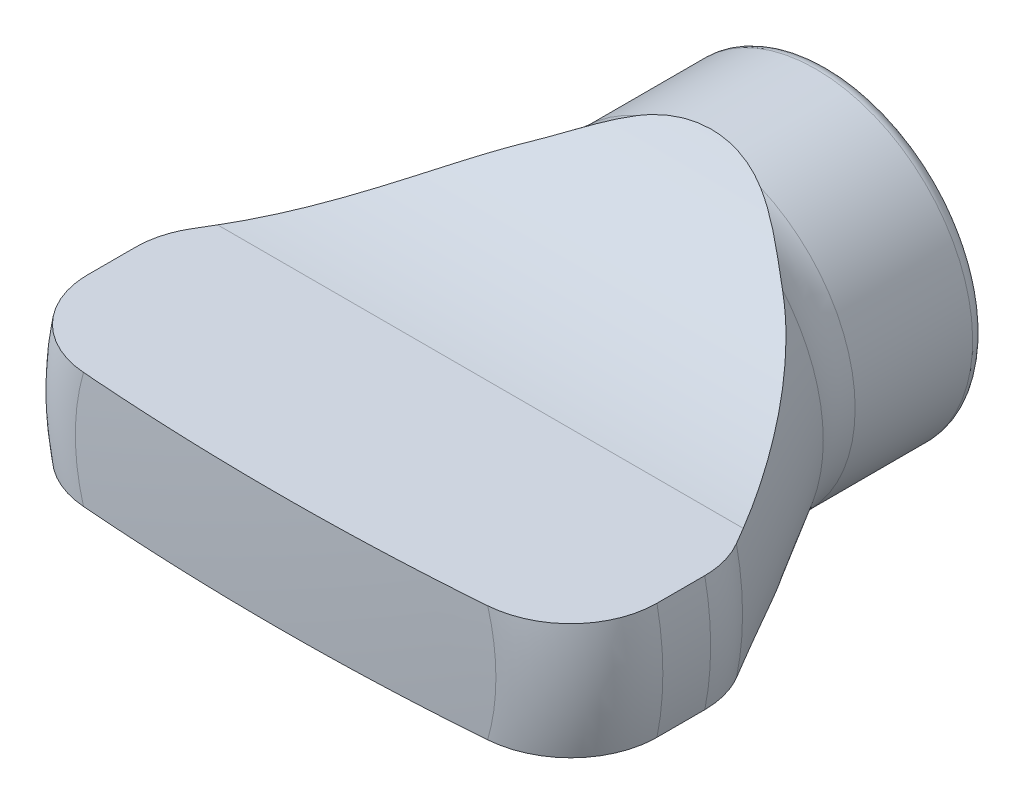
ISO-10303-21;
HEADER;
FILE_DESCRIPTION(('STEP AP214'),'2;1');
FILE_NAME('part.step','',(''),(''),'','','');
FILE_SCHEMA(('AUTOMOTIVE_DESIGN { 1 0 10303 214 1 1 1 1 }'));
ENDSEC;
DATA;
#1=APPLICATION_CONTEXT('core data for automotive mechanical design processes');
#2=APPLICATION_PROTOCOL_DEFINITION('international standard','automotive_design',2000,#1);
#3=PRODUCT_CONTEXT('',#1,'mechanical');
#4=PRODUCT('Part','Part','',(#3));
#5=PRODUCT_RELATED_PRODUCT_CATEGORY('part','',(#4));
#6=PRODUCT_DEFINITION_FORMATION('','',#4);
#7=PRODUCT_DEFINITION_CONTEXT('part definition',#1,'design');
#8=PRODUCT_DEFINITION('design','',#6,#7);
#9=PRODUCT_DEFINITION_SHAPE('','',#8);
#10=(LENGTH_UNIT() NAMED_UNIT(*) SI_UNIT(.MILLI.,.METRE.));
#11=(NAMED_UNIT(*) PLANE_ANGLE_UNIT() SI_UNIT($,.RADIAN.));
#12=(NAMED_UNIT(*) SI_UNIT($,.STERADIAN.) SOLID_ANGLE_UNIT());
#13=UNCERTAINTY_MEASURE_WITH_UNIT(LENGTH_MEASURE(1.E-05),#10,'distance_accuracy_value','');
#14=(GEOMETRIC_REPRESENTATION_CONTEXT(3) GLOBAL_UNCERTAINTY_ASSIGNED_CONTEXT((#13)) GLOBAL_UNIT_ASSIGNED_CONTEXT((#10,
#11,#12)) REPRESENTATION_CONTEXT('',''));
#15=CARTESIAN_POINT('',(0.,0.,0.));
#16=DIRECTION('',(0.,0.,1.));
#17=DIRECTION('',(1.,0.,0.));
#18=AXIS2_PLACEMENT_3D('',#15,#16,#17);
#19=CARTESIAN_POINT('',(-1.64018104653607E-12,0.,-71.0000000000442));
#20=DIRECTION('',(0.,0.,-1.));
#21=DIRECTION('',(1.,0.,0.));
#22=AXIS2_PLACEMENT_3D('',#19,#20,#21);
#23=SPHERICAL_SURFACE('',#22,90.0000000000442);
#24=CARTESIAN_POINT('',(0.,0.,18.7082071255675));
#25=DIRECTION('',(0.,0.,-1.));
#26=DIRECTION('',(0.,1.,0.));
#27=AXIS2_PLACEMENT_3D('',#24,#25,#26);
#28=CIRCLE('',#27,7.24137931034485);
#29=CARTESIAN_POINT('',(-6.95971079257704,-2.,18.7082071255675));
#30=VERTEX_POINT('',#29);
#31=CARTESIAN_POINT('',(-6.95971079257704,2.,18.7082071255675));
#32=VERTEX_POINT('',#31);
#33=EDGE_CURVE('E335',#30,#32,#28,.T.);
#34=ORIENTED_EDGE('',*,*,#33,.F.);
#35=CARTESIAN_POINT('',(-1.64018104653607E-12,-2.,-71.0000000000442));
#36=DIRECTION('',(0.,-1.,0.));
#37=DIRECTION('',(1.,0.,0.));
#38=AXIS2_PLACEMENT_3D('',#35,#36,#37);
#39=CIRCLE('',#38,89.9777750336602);
#40=CARTESIAN_POINT('',(6.9597107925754,-2.,18.7082071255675));
#41=VERTEX_POINT('',#40);
#42=EDGE_CURVE('E288',#30,#41,#39,.F.);
#43=ORIENTED_EDGE('',*,*,#42,.T.);
#44=CARTESIAN_POINT('',(6.9597107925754,2.,18.7082071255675));
#45=VERTEX_POINT('',#44);
#46=EDGE_CURVE('E336',#45,#41,#28,.T.);
#47=ORIENTED_EDGE('',*,*,#46,.F.);
#48=CARTESIAN_POINT('',(-1.64018104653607E-12,2.,-71.0000000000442));
#49=DIRECTION('',(0.,1.,0.));
#50=DIRECTION('',(-1.,0.,0.));
#51=AXIS2_PLACEMENT_3D('',#48,#49,#50);
#52=CIRCLE('',#51,89.9777750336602);
#53=EDGE_CURVE('E310',#45,#32,#52,.F.);
#54=ORIENTED_EDGE('',*,*,#53,.T.);
#55=EDGE_LOOP('',(#34,#43,#47,#54));
#56=FACE_BOUND('',#55,.T.);
#57=ADVANCED_FACE('F14',(#56),#23,.T.);
#58=CARTESIAN_POINT('',(0.,0.,15.7179335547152));
#59=DIRECTION('',(0.,0.,-1.));
#60=DIRECTION('',(0.,1.,0.));
#61=AXIS2_PLACEMENT_3D('',#58,#59,#60);
#62=TOROIDAL_SURFACE('',#61,7.,3.);
#63=CARTESIAN_POINT('',(0.,0.,15.7179335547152));
#64=DIRECTION('',(0.,0.,-1.));
#65=DIRECTION('',(0.,1.,0.));
#66=AXIS2_PLACEMENT_3D('',#63,#64,#65);
#67=CIRCLE('',#66,10.);
#68=CARTESIAN_POINT('',(-9.79795897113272,-2.,15.7179335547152));
#69=VERTEX_POINT('',#68);
#70=CARTESIAN_POINT('',(-9.79795897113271,2.,15.7179335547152));
#71=VERTEX_POINT('',#70);
#72=EDGE_CURVE('E332',#69,#71,#67,.T.);
#73=ORIENTED_EDGE('',*,*,#72,.F.);
#74=CARTESIAN_POINT('',(-9.1690514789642,-2.,17.5382309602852));
#75=CARTESIAN_POINT('',(-9.06353159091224,-2.,17.6732748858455));
#76=CARTESIAN_POINT('',(-8.94629487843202,-2.,17.7993591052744));
#77=CARTESIAN_POINT('',(-8.69206750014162,-2.,18.0299917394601));
#78=CARTESIAN_POINT('',(-8.5550465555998,-2.,18.1345065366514));
#79=CARTESIAN_POINT('',(-8.26572170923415,-2.,18.3190307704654));
#80=CARTESIAN_POINT('',(-8.11344388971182,-2.,18.3990811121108));
#81=CARTESIAN_POINT('',(-7.79789053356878,-2.,18.5330711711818));
#82=CARTESIAN_POINT('',(-7.63461799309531,-2.,18.5870179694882));
#83=CARTESIAN_POINT('',(-7.2978156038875,-2.,18.6687826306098));
#84=CARTESIAN_POINT('',(-7.12413832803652,-2.,18.6959921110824));
#85=CARTESIAN_POINT('',(-6.77467134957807,-2.,18.7219881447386));
#86=CARTESIAN_POINT('',(-6.59888118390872,-2.,18.7207683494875));
#87=CARTESIAN_POINT('',(-6.24322209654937,-2.,18.6898989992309));
#88=CARTESIAN_POINT('',(-6.06344497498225,-2.,18.6591927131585));
#89=CARTESIAN_POINT('',(-5.71121970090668,-2.,18.5691241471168));
#90=CARTESIAN_POINT('',(-5.53877299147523,-2.,18.5097562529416));
#91=CARTESIAN_POINT('',(-5.19956390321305,-2.,18.3615562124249));
#92=CARTESIAN_POINT('',(-5.03323229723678,-2.,18.2717366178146));
#93=CARTESIAN_POINT('',(-4.71772687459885,-2.,18.0656595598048));
#94=CARTESIAN_POINT('',(-4.56855961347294,-2.,17.9493920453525));
#95=CARTESIAN_POINT('',(-4.29105412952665,-2.,17.6921762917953));
#96=CARTESIAN_POINT('',(-4.16288688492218,-2.,17.5510431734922));
#97=CARTESIAN_POINT('',(-3.93401349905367,-2.,17.2477837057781));
#98=CARTESIAN_POINT('',(-3.83329575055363,-2.,17.085666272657));
#99=CARTESIAN_POINT('',(-3.71017324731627,-2.,16.8361950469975));
#100=CARTESIAN_POINT('',(-3.67466394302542,-2.,16.7551271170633));
#101=CARTESIAN_POINT('',(-3.61144842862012,-2.,16.5900195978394));
#102=CARTESIAN_POINT('',(-3.58373774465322,-2.,16.5059817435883));
#103=CARTESIAN_POINT('',(-3.53666405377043,-2.,16.3356866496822));
#104=CARTESIAN_POINT('',(-3.51729299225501,-2.,16.2494316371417));
#105=CARTESIAN_POINT('',(-3.48727342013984,-2.,16.0754171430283));
#106=CARTESIAN_POINT('',(-3.47662363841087,-2.,15.9876578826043));
#107=CARTESIAN_POINT('',(-3.46508469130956,-2.,15.8228751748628));
#108=CARTESIAN_POINT('',(-3.46311452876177,-2.,15.7459256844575));
#109=CARTESIAN_POINT('',(-3.4660093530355,-2.,15.5921292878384));
#110=CARTESIAN_POINT('',(-3.47087649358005,-2.,15.515282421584));
#111=CARTESIAN_POINT('',(-3.48736245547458,-2.,15.3623449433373));
#112=CARTESIAN_POINT('',(-3.49897870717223,-2.,15.2862540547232));
#113=CARTESIAN_POINT('',(-3.52875395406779,-2.,15.1353538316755));
#114=CARTESIAN_POINT('',(-3.54691549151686,-2.,15.0605450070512));
#115=CARTESIAN_POINT('',(-3.60908093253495,-2.,14.8448499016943));
#116=CARTESIAN_POINT('',(-3.66150708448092,-2.,14.7063085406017));
#117=CARTESIAN_POINT('',(-3.78683170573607,-2.,14.4389489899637));
#118=CARTESIAN_POINT('',(-3.85973615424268,-2.,14.3101336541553));
#119=CARTESIAN_POINT('',(-4.03113254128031,-2.,14.0525149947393));
#120=CARTESIAN_POINT('',(-4.13140818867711,-2.,13.9248982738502));
#121=CARTESIAN_POINT('',(-4.34987502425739,-2.,13.6860687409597));
#122=CARTESIAN_POINT('',(-4.46807460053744,-2.,13.5748636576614));
#123=CARTESIAN_POINT('',(-4.73397591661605,-2.,13.3588045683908));
#124=CARTESIAN_POINT('',(-4.88351037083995,-2.,13.2561988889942));
#125=CARTESIAN_POINT('',(-5.19700820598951,-2.,13.0760618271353));
#126=CARTESIAN_POINT('',(-5.36097604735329,-2.,12.9985382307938));
#127=CARTESIAN_POINT('',(-5.70796944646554,-2.,12.8673176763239));
#128=CARTESIAN_POINT('',(-5.89154196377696,-2.,12.8150589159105));
#129=CARTESIAN_POINT('',(-6.26492080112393,-2.,12.7425150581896));
#130=CARTESIAN_POINT('',(-6.45472700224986,-2.,12.7222293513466));
#131=CARTESIAN_POINT('',(-6.83263411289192,-2.,12.7149109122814));
#132=CARTESIAN_POINT('',(-7.02072665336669,-2.,12.7274653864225));
#133=CARTESIAN_POINT('',(-7.39183456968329,-2.,12.7852685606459));
#134=CARTESIAN_POINT('',(-7.57485093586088,-2.,12.8305108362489));
#135=CARTESIAN_POINT('',(-7.92313555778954,-2.,12.9505733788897));
#136=CARTESIAN_POINT('',(-8.08881410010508,-2.,13.0242031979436));
#137=CARTESIAN_POINT('',(-8.40477257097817,-2.,13.1992715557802));
#138=CARTESIAN_POINT('',(-8.55505576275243,-2.,13.3007041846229));
#139=CARTESIAN_POINT('',(-8.83007287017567,-2.,13.5243742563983));
#140=CARTESIAN_POINT('',(-8.95554673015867,-2.,13.645702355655));
#141=CARTESIAN_POINT('',(-9.18364139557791,-2.,13.9082202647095));
#142=CARTESIAN_POINT('',(-9.28626589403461,-2.,14.0494068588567));
#143=CARTESIAN_POINT('',(-9.46288130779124,-2.,14.3434525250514));
#144=CARTESIAN_POINT('',(-9.53757493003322,-2.,14.4958898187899));
#145=CARTESIAN_POINT('',(-9.65982030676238,-2.,14.811276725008));
#146=CARTESIAN_POINT('',(-9.70737610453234,-2.,14.9742247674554));
#147=CARTESIAN_POINT('',(-9.77329183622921,-2.,15.3031274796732));
#148=CARTESIAN_POINT('',(-9.79211873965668,-2.,15.4689887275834));
#149=CARTESIAN_POINT('',(-9.80147415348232,-2.,15.8015555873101));
#150=CARTESIAN_POINT('',(-9.79199607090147,-2.,15.9682613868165));
#151=CARTESIAN_POINT('',(-9.74516646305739,-2.,16.2967408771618));
#152=CARTESIAN_POINT('',(-9.70796979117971,-2.,16.4585367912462));
#153=CARTESIAN_POINT('',(-9.60704397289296,-2.,16.7734590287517));
#154=CARTESIAN_POINT('',(-9.5433508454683,-2.,16.9265968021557));
#155=CARTESIAN_POINT('',(-9.42505553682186,-2.,17.1551805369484));
#156=CARTESIAN_POINT('',(-9.37885045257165,-2.,17.2350829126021));
#157=CARTESIAN_POINT('',(-9.27924541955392,-2.,17.390265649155));
#158=CARTESIAN_POINT('',(-9.22584559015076,-2.,17.4655460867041));
#159=CARTESIAN_POINT('',(-9.1690514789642,-2.,17.5382309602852));
#160=B_SPLINE_CURVE_WITH_KNOTS('',3,(#74,#75,#76,#77,#78,#79,#80,#81,#82,#83,#84,#85,#86,#87,
#88,#89,#90,#91,#92,#93,#94,#95,#96,#97,#98,#99,#100,#101,#102,#103,#104,#105,#106,#107,#108,
#109,#110,#111,#112,#113,#114,#115,#116,#117,#118,#119,#120,#121,#122,#123,#124,#125,#126,#127,
#128,#129,#130,#131,#132,#133,#134,#135,#136,#137,#138,#139,#140,#141,#142,#143,#144,#145,#146,
#147,#148,#149,#150,#151,#152,#153,#154,#155,#156,#157,#158,#159),.UNSPECIFIED.,.T.,.F.,(4,2,2,
2,2,2,2,2,2,2,2,2,2,2,2,2,2,2,2,2,2,2,2,2,2,2,2,2,2,2,2,2,2,2,2,2,2,2,2,2,2,2,4),(0.,
0.513793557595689,1.02838195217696,1.54210517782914,2.05568897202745,2.58070552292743,
3.10583931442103,3.65052350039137,4.19531442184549,4.75979734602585,5.32449515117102,
5.89358385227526,6.46243153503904,6.72762510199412,6.99266622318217,7.25745078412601,
7.52219674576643,7.75282442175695,7.98352476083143,8.21413732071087,8.44483954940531,
8.88719956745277,9.32968887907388,9.81462652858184,10.2997918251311,10.8414656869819,
11.3833075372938,11.9531481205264,12.5229778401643,13.0856794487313,13.6482704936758,
14.1894634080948,14.7305413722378,15.2515859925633,15.7725463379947,16.2793411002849,
16.7860603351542,17.2844519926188,17.7829597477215,18.278703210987,18.7737749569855,
19.0503193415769,19.3268591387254),.UNSPECIFIED.);
#161=EDGE_CURVE('E345',#69,#30,#160,.T.);
#162=ORIENTED_EDGE('',*,*,#161,.T.);
#163=ORIENTED_EDGE('',*,*,#33,.T.);
#164=CARTESIAN_POINT('',(-9.1690514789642,2.,17.5382309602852));
#165=CARTESIAN_POINT('',(-9.27149654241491,2.,17.4070966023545));
#166=CARTESIAN_POINT('',(-9.36305742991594,2.,17.2673129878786));
#167=CARTESIAN_POINT('',(-9.52154430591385,2.,16.9742704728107));
#168=CARTESIAN_POINT('',(-9.58844385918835,2.,16.8209973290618));
#169=CARTESIAN_POINT('',(-9.69546141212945,2.,16.5053514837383));
#170=CARTESIAN_POINT('',(-9.73557989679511,2.,16.3429789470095));
#171=CARTESIAN_POINT('',(-9.78776824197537,2.,16.0138250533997));
#172=CARTESIAN_POINT('',(-9.79984467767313,2.,15.8470447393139));
#173=CARTESIAN_POINT('',(-9.7956090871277,2.,15.5149402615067));
#174=CARTESIAN_POINT('',(-9.77948227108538,2.,15.3496137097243));
#175=CARTESIAN_POINT('',(-9.71969439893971,2.,15.0240176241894));
#176=CARTESIAN_POINT('',(-9.67603297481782,2.,14.8637481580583));
#177=CARTESIAN_POINT('',(-9.5625163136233,2.,14.5527855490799));
#178=CARTESIAN_POINT('',(-9.49266198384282,2.,14.4020920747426));
#179=CARTESIAN_POINT('',(-9.32887528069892,2.,14.1144245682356));
#180=CARTESIAN_POINT('',(-9.23494229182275,2.,13.9774508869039));
#181=CARTESIAN_POINT('',(-9.02477844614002,2.,13.7196361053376));
#182=CARTESIAN_POINT('',(-8.9083417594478,2.,13.5989628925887));
#183=CARTESIAN_POINT('',(-8.65720404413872,2.,13.3784343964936));
#184=CARTESIAN_POINT('',(-8.52250172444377,2.,13.2785805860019));
#185=CARTESIAN_POINT('',(-8.2359104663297,2.,13.1003649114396));
#186=CARTESIAN_POINT('',(-8.08373796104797,2.,13.0224593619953));
#187=CARTESIAN_POINT('',(-7.76874637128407,2.,12.8924882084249));
#188=CARTESIAN_POINT('',(-7.60592601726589,2.,12.840425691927));
#189=CARTESIAN_POINT('',(-7.2691862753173,2.,12.7619085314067));
#190=CARTESIAN_POINT('',(-7.09508138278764,2.,12.7362504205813));
#191=CARTESIAN_POINT('',(-6.74502465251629,2.,12.7134057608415));
#192=CARTESIAN_POINT('',(-6.5690724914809,2.,12.7162242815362));
#193=CARTESIAN_POINT('',(-6.21333371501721,2.,12.7503564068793));
#194=CARTESIAN_POINT('',(-6.0336487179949,2.,12.7827284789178));
#195=CARTESIAN_POINT('',(-5.68187732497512,2.,12.8760995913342));
#196=CARTESIAN_POINT('',(-5.50979244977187,2.,12.937104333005));
#197=CARTESIAN_POINT('',(-5.17164281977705,2.,13.0885555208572));
#198=CARTESIAN_POINT('',(-5.00601492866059,2.,13.1799788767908));
#199=CARTESIAN_POINT('',(-4.69219987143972,2.,13.3891635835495));
#200=CARTESIAN_POINT('',(-4.54401947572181,2.,13.5069351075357));
#201=CARTESIAN_POINT('',(-4.26900633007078,2.,13.7668554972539));
#202=CARTESIAN_POINT('',(-4.1423143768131,2.,13.9091536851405));
#203=CARTESIAN_POINT('',(-3.91667263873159,2.,14.2145097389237));
#204=CARTESIAN_POINT('',(-3.81770963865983,2.,14.3775576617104));
#205=CARTESIAN_POINT('',(-3.69746879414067,2.,14.6279400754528));
#206=CARTESIAN_POINT('',(-3.66295810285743,2.,14.7091022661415));
#207=CARTESIAN_POINT('',(-3.60174866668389,2.,14.8743051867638));
#208=CARTESIAN_POINT('',(-3.57504543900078,2.,14.9583442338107));
#209=CARTESIAN_POINT('',(-3.52997967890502,2.,15.1285445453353));
#210=CARTESIAN_POINT('',(-3.51160924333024,2.,15.2147037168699));
#211=CARTESIAN_POINT('',(-3.48356557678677,2.,15.3884256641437));
#212=CARTESIAN_POINT('',(-3.4738911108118,2.,15.4759882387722));
#213=CARTESIAN_POINT('',(-3.46413096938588,2.,15.6403273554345));
#214=CARTESIAN_POINT('',(-3.46297157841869,2.,15.7170418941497));
#215=CARTESIAN_POINT('',(-3.46743972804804,2.,15.8702988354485));
#216=CARTESIAN_POINT('',(-3.47306940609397,2.,15.9468411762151));
#217=CARTESIAN_POINT('',(-3.49101899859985,2.,16.0991104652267));
#218=CARTESIAN_POINT('',(-3.50333652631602,2.,16.1748376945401));
#219=CARTESIAN_POINT('',(-3.53444439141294,2.,16.324960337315));
#220=CARTESIAN_POINT('',(-3.55323724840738,2.,16.3993552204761));
#221=CARTESIAN_POINT('',(-3.61732134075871,2.,16.6144115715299));
#222=CARTESIAN_POINT('',(-3.67103587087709,2.,16.7526459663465));
#223=CARTESIAN_POINT('',(-3.79882726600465,2.,17.0192261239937));
#224=CARTESIAN_POINT('',(-3.87291010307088,2.,17.1475689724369));
#225=CARTESIAN_POINT('',(-4.04685580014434,2.,17.404346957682));
#226=CARTESIAN_POINT('',(-4.14853718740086,2.,17.5315505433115));
#227=CARTESIAN_POINT('',(-4.36975558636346,2.,17.7693319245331));
#228=CARTESIAN_POINT('',(-4.48930103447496,2.,17.8799018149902));
#229=CARTESIAN_POINT('',(-4.7578335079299,2.,18.0942671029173));
#230=CARTESIAN_POINT('',(-4.9086260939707,2.,18.1958080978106));
#231=CARTESIAN_POINT('',(-5.22448220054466,2.,18.373571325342));
#232=CARTESIAN_POINT('',(-5.3895500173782,2.,18.4497859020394));
#233=CARTESIAN_POINT('',(-5.73823359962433,2.,18.5779397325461));
#234=CARTESIAN_POINT('',(-5.92236313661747,2.,18.6284890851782));
#235=CARTESIAN_POINT('',(-6.29655422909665,2.,18.697497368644));
#236=CARTESIAN_POINT('',(-6.48661538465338,2.,18.7159584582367));
#237=CARTESIAN_POINT('',(-6.86444459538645,2.,18.719582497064));
#238=CARTESIAN_POINT('',(-7.05220786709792,2.,18.7052040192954));
#239=CARTESIAN_POINT('',(-7.42239672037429,2.,18.6438219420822));
#240=CARTESIAN_POINT('',(-7.60482190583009,2.,18.5968159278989));
#241=CARTESIAN_POINT('',(-7.95167799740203,2.,18.473413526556));
#242=CARTESIAN_POINT('',(-8.11652825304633,2.,18.3981938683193));
#243=CARTESIAN_POINT('',(-8.43039951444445,2.,18.2201652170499));
#244=CARTESIAN_POINT('',(-8.57944450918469,2.,18.1173988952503));
#245=CARTESIAN_POINT('',(-8.80131054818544,2.,17.9333424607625));
#246=CARTESIAN_POINT('',(-8.88077170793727,2.,17.8599076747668));
#247=CARTESIAN_POINT('',(-9.03136976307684,2.,17.7049419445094));
#248=CARTESIAN_POINT('',(-9.10250682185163,2.,17.6234111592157));
#249=CARTESIAN_POINT('',(-9.1690514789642,2.,17.5382309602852));
#250=B_SPLINE_CURVE_WITH_KNOTS('',3,(#164,#165,#166,#167,#168,#169,#170,#171,#172,#173,#174,
#175,#176,#177,#178,#179,#180,#181,#182,#183,#184,#185,#186,#187,#188,#189,#190,#191,#192,#193,
#194,#195,#196,#197,#198,#199,#200,#201,#202,#203,#204,#205,#206,#207,#208,#209,#210,#211,#212,
#213,#214,#215,#216,#217,#218,#219,#220,#221,#222,#223,#224,#225,#226,#227,#228,#229,#230,#231,
#232,#233,#234,#235,#236,#237,#238,#239,#240,#241,#242,#243,#244,#245,#246,#247,#248,#249),
.UNSPECIFIED.,.T.,.F.,(4,2,2,2,2,2,2,2,2,2,2,2,2,2,2,2,2,2,2,2,2,2,2,2,2,2,2,2,2,2,2,2,2,2,2,2,
2,2,2,2,2,2,4),(0.,0.498830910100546,0.99819498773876,1.49755002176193,1.99678795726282,
2.49275970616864,2.98873808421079,3.48469928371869,3.9806731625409,4.48141873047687,
4.98219971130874,5.49273116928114,6.00332360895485,6.52890361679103,7.05457719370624,
7.59984951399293,8.14523045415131,8.71015958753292,9.27530722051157,9.84402563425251,
10.4124725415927,10.6767393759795,10.9408541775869,11.2047179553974,11.4685442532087,
11.6984204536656,11.9283690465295,12.1582356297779,12.3881917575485,12.8310811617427,
13.2741005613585,13.7606768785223,14.2474837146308,14.7904703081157,15.3336208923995,
15.903683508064,16.473707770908,17.0358209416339,17.5979757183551,18.138904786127,
18.6790007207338,19.0030298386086,19.3270525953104),.UNSPECIFIED.);
#251=EDGE_CURVE('E304',#32,#71,#250,.T.);
#252=ORIENTED_EDGE('',*,*,#251,.T.);
#253=EDGE_LOOP('',(#73,#162,#163,#252));
#254=FACE_BOUND('',#253,.T.);
#255=ADVANCED_FACE('F290',(#254),#62,.T.);
#256=CARTESIAN_POINT('',(9.79795897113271,2.,15.7179335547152));
#257=VERTEX_POINT('',#256);
#258=CARTESIAN_POINT('',(9.79795897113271,-2.,15.7179335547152));
#259=VERTEX_POINT('',#258);
#260=EDGE_CURVE('E333',#257,#259,#67,.T.);
#261=ORIENTED_EDGE('',*,*,#260,.F.);
#262=CARTESIAN_POINT('',(3.49470247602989,2.,16.1160256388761));
#263=CARTESIAN_POINT('',(3.47178318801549,2.,15.9673696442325));
#264=CARTESIAN_POINT('',(3.46162568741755,2.,15.8166484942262));
#265=CARTESIAN_POINT('',(3.46760947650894,2.,15.5156637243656));
#266=CARTESIAN_POINT('',(3.48376975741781,2.,15.3654005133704));
#267=CARTESIAN_POINT('',(3.54121822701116,2.,15.0702140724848));
#268=CARTESIAN_POINT('',(3.58244137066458,2.,14.9252780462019));
#269=CARTESIAN_POINT('',(3.68755339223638,2.,14.6439179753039));
#270=CARTESIAN_POINT('',(3.75144933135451,2.,14.5074965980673));
#271=CARTESIAN_POINT('',(3.90236096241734,2.,14.2399242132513));
#272=CARTESIAN_POINT('',(3.99029422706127,2.,14.1092932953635));
#273=CARTESIAN_POINT('',(4.18453508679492,2.,13.862529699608));
#274=CARTESIAN_POINT('',(4.29084904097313,2.,13.7464020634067));
#275=CARTESIAN_POINT('',(4.53309198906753,2.,13.5170524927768));
#276=CARTESIAN_POINT('',(4.67105874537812,2.,13.405978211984));
#277=CARTESIAN_POINT('',(4.96264893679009,2.,13.2067036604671));
#278=CARTESIAN_POINT('',(5.11627878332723,2.,13.1185128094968));
#279=CARTESIAN_POINT('',(5.44668157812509,2.,12.9617130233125));
#280=CARTESIAN_POINT('',(5.62432258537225,2.,12.8949240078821));
#281=CARTESIAN_POINT('',(5.98831222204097,2.,12.7920926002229));
#282=CARTESIAN_POINT('',(6.17466126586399,2.,12.7560516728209));
#283=CARTESIAN_POINT('',(6.55082069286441,2.,12.7162994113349));
#284=CARTESIAN_POINT('',(6.74063118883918,2.,12.7125891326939));
#285=CARTESIAN_POINT('',(7.11801183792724,2.,12.7383031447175));
#286=CARTESIAN_POINT('',(7.30558236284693,2.,12.7677218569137));
#287=CARTESIAN_POINT('',(7.6660812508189,2.,12.8578405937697));
#288=CARTESIAN_POINT('',(7.83929237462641,2.,12.9174084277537));
#289=CARTESIAN_POINT('',(8.17263048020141,2.,13.0659330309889));
#290=CARTESIAN_POINT('',(8.33276032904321,2.,13.1548833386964));
#291=CARTESIAN_POINT('',(8.62882312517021,2.,13.3558741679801));
#292=CARTESIAN_POINT('',(8.76545156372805,2.,13.4668906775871));
#293=CARTESIAN_POINT('',(9.01740318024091,2.,13.7109266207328));
#294=CARTESIAN_POINT('',(9.13273016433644,2.,13.8439421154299));
#295=CARTESIAN_POINT('',(9.33522917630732,2.,14.1238602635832));
#296=CARTESIAN_POINT('',(9.42313969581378,2.,14.2702290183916));
#297=CARTESIAN_POINT('',(9.5725877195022,2.,14.5758632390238));
#298=CARTESIAN_POINT('',(9.63412834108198,2.,14.7351271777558));
#299=CARTESIAN_POINT('',(9.72796602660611,2.,15.0587661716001));
#300=CARTESIAN_POINT('',(9.76079555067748,2.,15.2229870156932));
#301=CARTESIAN_POINT('',(9.79815532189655,2.,15.5546142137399));
#302=CARTESIAN_POINT('',(9.80268733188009,2.,15.7220203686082));
#303=CARTESIAN_POINT('',(9.783396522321,2.,16.0537478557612));
#304=CARTESIAN_POINT('',(9.75981558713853,2.,16.2180833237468));
#305=CARTESIAN_POINT('',(9.68542885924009,2.,16.5404663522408));
#306=CARTESIAN_POINT('',(9.63462342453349,2.,16.6985139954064));
#307=CARTESIAN_POINT('',(9.50725835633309,2.,17.0040925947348));
#308=CARTESIAN_POINT('',(9.43066629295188,2.,17.1516100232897));
#309=CARTESIAN_POINT('',(9.25405639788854,2.,17.4318722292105));
#310=CARTESIAN_POINT('',(9.15403777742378,2.,17.5646165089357));
#311=CARTESIAN_POINT('',(8.93232327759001,2.,17.813182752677));
#312=CARTESIAN_POINT('',(8.81040257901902,2.,17.9288040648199));
#313=CARTESIAN_POINT('',(8.54922533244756,2.,18.1384269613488));
#314=CARTESIAN_POINT('',(8.40996746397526,2.,18.2324268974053));
#315=CARTESIAN_POINT('',(8.11502606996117,2.,18.3983126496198));
#316=CARTESIAN_POINT('',(7.95906107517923,2.,18.4696976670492));
#317=CARTESIAN_POINT('',(7.63760671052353,2.,18.5861331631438));
#318=CARTESIAN_POINT('',(7.47211609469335,2.,18.6311801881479));
#319=CARTESIAN_POINT('',(7.13092550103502,2.,18.6952067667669));
#320=CARTESIAN_POINT('',(6.95506807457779,2.,18.713346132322));
#321=CARTESIAN_POINT('',(6.60274361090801,2.,18.7209892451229));
#322=CARTESIAN_POINT('',(6.42627647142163,2.,18.7104879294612));
#323=CARTESIAN_POINT('',(6.07062168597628,2.,18.660713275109));
#324=CARTESIAN_POINT('',(5.89158461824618,2.,18.6203640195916));
#325=CARTESIAN_POINT('',(5.54240746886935,2.,18.5112038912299));
#326=CARTESIAN_POINT('',(5.37226905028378,2.,18.4423877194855));
#327=CARTESIAN_POINT('',(5.03970097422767,2.,18.2754918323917));
#328=CARTESIAN_POINT('',(4.87772940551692,2.,18.1764975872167));
#329=CARTESIAN_POINT('',(4.57254419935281,2.,17.9526627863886));
#330=CARTESIAN_POINT('',(4.42934307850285,2.,17.8278051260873));
#331=CARTESIAN_POINT('',(4.16673595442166,2.,17.5552344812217));
#332=CARTESIAN_POINT('',(4.04731633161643,2.,17.4075346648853));
#333=CARTESIAN_POINT('',(3.83775587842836,2.,17.092836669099));
#334=CARTESIAN_POINT('',(3.74754666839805,2.,16.9258848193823));
#335=CARTESIAN_POINT('',(3.63217899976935,2.,16.6498982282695));
#336=CARTESIAN_POINT('',(3.59555746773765,2.,16.545554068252));
#337=CARTESIAN_POINT('',(3.53523351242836,2.,16.3331857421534));
#338=CARTESIAN_POINT('',(3.51152879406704,2.,16.2251622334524));
#339=CARTESIAN_POINT('',(3.49470247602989,2.,16.1160256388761));
#340=B_SPLINE_CURVE_WITH_KNOTS('',3,(#262,#263,#264,#265,#266,#267,#268,#269,#270,#271,#272,
#273,#274,#275,#276,#277,#278,#279,#280,#281,#282,#283,#284,#285,#286,#287,#288,#289,#290,#291,
#292,#293,#294,#295,#296,#297,#298,#299,#300,#301,#302,#303,#304,#305,#306,#307,#308,#309,#310,
#311,#312,#313,#314,#315,#316,#317,#318,#319,#320,#321,#322,#323,#324,#325,#326,#327,#328,#329,
#330,#331,#332,#333,#334,#335,#336,#337,#338,#339),.UNSPECIFIED.,.T.,.F.,(4,2,2,2,2,2,2,2,2,2,2,
2,2,2,2,2,2,2,2,2,2,2,2,2,2,2,2,2,2,2,2,2,2,2,2,2,2,2,4),(0.,0.450820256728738,
0.901965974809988,1.35194581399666,1.80206591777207,2.27261200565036,2.74332121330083,
3.27242460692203,3.8017454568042,4.36840101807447,4.93508357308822,5.50178462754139,
6.06839027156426,6.6151425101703,7.16177459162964,7.687303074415,8.21273756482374,
8.72246744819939,9.23213705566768,9.73214095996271,10.2321137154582,10.7278155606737,
11.2235108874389,11.7198319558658,12.2161697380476,12.7179283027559,13.2197251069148,
13.7319623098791,14.244266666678,14.7722536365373,15.3003339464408,15.8484387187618,
16.3966455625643,16.9634718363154,17.5306741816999,18.0975507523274,18.6630905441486,
18.9941214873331,19.3250935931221),.UNSPECIFIED.);
#341=EDGE_CURVE('E297',#257,#45,#340,.T.);
#342=ORIENTED_EDGE('',*,*,#341,.T.);
#343=ORIENTED_EDGE('',*,*,#46,.T.);
#344=CARTESIAN_POINT('',(3.49470247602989,-2.,16.1160256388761));
#345=CARTESIAN_POINT('',(3.50707030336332,-2.,16.196197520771));
#346=CARTESIAN_POINT('',(3.5231438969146,-2.,16.275804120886));
#347=CARTESIAN_POINT('',(3.56239972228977,-2.,16.4332567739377));
#348=CARTESIAN_POINT('',(3.58558547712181,-2.,16.5111019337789));
#349=CARTESIAN_POINT('',(3.66535853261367,-2.,16.7414027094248));
#350=CARTESIAN_POINT('',(3.73213249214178,-2.,16.8904418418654));
#351=CARTESIAN_POINT('',(3.88861553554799,-2.,17.1746149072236));
#352=CARTESIAN_POINT('',(3.97819351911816,-2.,17.3098223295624));
#353=CARTESIAN_POINT('',(4.17690289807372,-2.,17.5648904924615));
#354=CARTESIAN_POINT('',(4.28602992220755,-2.,17.6847546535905));
#355=CARTESIAN_POINT('',(4.53121457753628,-2.,17.9171961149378));
#356=CARTESIAN_POINT('',(4.66881113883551,-2.,18.0281502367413));
#357=CARTESIAN_POINT('',(4.95962281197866,-2.,18.2272945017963));
#358=CARTESIAN_POINT('',(5.11284409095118,-2.,18.3154756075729));
#359=CARTESIAN_POINT('',(5.44271072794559,-2.,18.472530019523));
#360=CARTESIAN_POINT('',(5.62024907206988,-2.,18.5395370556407));
#361=CARTESIAN_POINT('',(5.98407556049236,-2.,18.6428270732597));
#362=CARTESIAN_POINT('',(6.17036438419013,-2.,18.6791076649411));
#363=CARTESIAN_POINT('',(6.54647691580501,-2.,18.719356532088));
#364=CARTESIAN_POINT('',(6.73630133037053,-2.,18.7233182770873));
#365=CARTESIAN_POINT('',(7.11375145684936,-2.,18.6981031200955));
#366=CARTESIAN_POINT('',(7.30137755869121,-2.,18.6689321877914));
#367=CARTESIAN_POINT('',(7.66204066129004,-2.,18.5792858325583));
#368=CARTESIAN_POINT('',(7.8353584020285,-2.,18.5199409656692));
#369=CARTESIAN_POINT('',(8.16894750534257,-2.,18.3718393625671));
#370=CARTESIAN_POINT('',(8.32922167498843,-2.,18.2830889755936));
#371=CARTESIAN_POINT('',(8.62559607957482,-2.,18.0824630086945));
#372=CARTESIAN_POINT('',(8.76239095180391,-2.,17.9716131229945));
#373=CARTESIAN_POINT('',(9.01470063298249,-2.,17.727878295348));
#374=CARTESIAN_POINT('',(9.13021927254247,-2.,17.5949973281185));
#375=CARTESIAN_POINT('',(9.33311030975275,-2.,17.3153137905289));
#376=CARTESIAN_POINT('',(9.42122162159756,-2.,17.1690469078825));
#377=CARTESIAN_POINT('',(9.57108453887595,-2.,16.8635800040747));
#378=CARTESIAN_POINT('',(9.6328392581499,-2.,16.7043815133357));
#379=CARTESIAN_POINT('',(9.7271052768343,-2.,16.3808410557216));
#380=CARTESIAN_POINT('',(9.7601500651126,-2.,16.216654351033));
#381=CARTESIAN_POINT('',(9.79794187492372,-2.,15.885058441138));
#382=CARTESIAN_POINT('',(9.80269066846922,-2.,15.7176494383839));
#383=CARTESIAN_POINT('',(9.78382667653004,-2.,15.3858863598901));
#384=CARTESIAN_POINT('',(9.7604569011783,-2.,15.2215183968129));
#385=CARTESIAN_POINT('',(9.68648301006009,-2.,14.8990356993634));
#386=CARTESIAN_POINT('',(9.63587925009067,-2.,14.7409208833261));
#387=CARTESIAN_POINT('',(9.50890463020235,-2.,14.4351813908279));
#388=CARTESIAN_POINT('',(9.43250225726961,-2.,14.2875698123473));
#389=CARTESIAN_POINT('',(9.25625267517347,-2.,14.0070898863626));
#390=CARTESIAN_POINT('',(9.15640470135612,-2.,13.8742220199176));
#391=CARTESIAN_POINT('',(8.9350136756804,-2.,13.6253865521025));
#392=CARTESIAN_POINT('',(8.81324633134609,-2.,13.5096186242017));
#393=CARTESIAN_POINT('',(8.55234864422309,-2.,13.2996798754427));
#394=CARTESIAN_POINT('',(8.4132169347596,-2.,13.2055107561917));
#395=CARTESIAN_POINT('',(8.11850563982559,-2.,13.03926914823));
#396=CARTESIAN_POINT('',(7.96264445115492,-2.,12.9676962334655));
#397=CARTESIAN_POINT('',(7.64136656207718,-2.,12.850872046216));
#398=CARTESIAN_POINT('',(7.47594867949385,-2.,12.8056240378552));
#399=CARTESIAN_POINT('',(7.1348783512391,-2.,12.7411826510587));
#400=CARTESIAN_POINT('',(6.95906762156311,-2.,12.7228281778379));
#401=CARTESIAN_POINT('',(6.60679938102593,-2.,12.7147502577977));
#402=CARTESIAN_POINT('',(6.43034175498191,-2.,12.725032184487));
#403=CARTESIAN_POINT('',(6.07467605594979,-2.,12.7743612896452));
#404=CARTESIAN_POINT('',(5.89561707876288,-2.,12.8144835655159));
#405=CARTESIAN_POINT('',(5.54635691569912,-2.,12.9231927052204));
#406=CARTESIAN_POINT('',(5.37615756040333,-2.,12.9917854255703));
#407=CARTESIAN_POINT('',(5.04338946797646,-2.,13.1582640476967));
#408=CARTESIAN_POINT('',(4.88128017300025,-2.,13.2570707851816));
#409=CARTESIAN_POINT('',(4.57585396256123,-2.,13.4804777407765));
#410=CARTESIAN_POINT('',(4.43254379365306,-2.,13.6050871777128));
#411=CARTESIAN_POINT('',(4.16966907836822,-2.,13.877249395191));
#412=CARTESIAN_POINT('',(4.05007738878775,-2.,14.0247756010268));
#413=CARTESIAN_POINT('',(3.89254775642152,-2.,14.2604657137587));
#414=CARTESIAN_POINT('',(3.84366142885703,-2.,14.3414744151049));
#415=CARTESIAN_POINT('',(3.75387086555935,-2.,14.507781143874));
#416=CARTESIAN_POINT('',(3.71296169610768,-2.,14.5930764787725));
#417=CARTESIAN_POINT('',(3.64284669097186,-2.,14.7601343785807));
#418=CARTESIAN_POINT('',(3.61295453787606,-2.,14.8416094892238));
#419=CARTESIAN_POINT('',(3.5610172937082,-2.,15.0069833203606));
#420=CARTESIAN_POINT('',(3.53896754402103,-2.,15.090880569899));
#421=CARTESIAN_POINT('',(3.5031702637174,-2.,15.2602415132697));
#422=CARTESIAN_POINT('',(3.4894047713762,-2.,15.3457014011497));
#423=CARTESIAN_POINT('',(3.47040653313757,-2.,15.5175250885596));
#424=CARTESIAN_POINT('',(3.46516895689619,-2.,15.6038883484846));
#425=CARTESIAN_POINT('',(3.46349011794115,-2.,15.7615090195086));
#426=CARTESIAN_POINT('',(3.46566524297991,-2.,15.8327549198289));
#427=CARTESIAN_POINT('',(3.47584274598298,-2.,15.9748209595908));
#428=CARTESIAN_POINT('',(3.48384451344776,-2.,16.045641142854));
#429=CARTESIAN_POINT('',(3.49470247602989,-2.,16.1160256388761));
#430=B_SPLINE_CURVE_WITH_KNOTS('',3,(#344,#345,#346,#347,#348,#349,#350,#351,#352,#353,#354,
#355,#356,#357,#358,#359,#360,#361,#362,#363,#364,#365,#366,#367,#368,#369,#370,#371,#372,#373,
#374,#375,#376,#377,#378,#379,#380,#381,#382,#383,#384,#385,#386,#387,#388,#389,#390,#391,#392,
#393,#394,#395,#396,#397,#398,#399,#400,#401,#402,#403,#404,#405,#406,#407,#408,#409,#410,#411,
#412,#413,#414,#415,#416,#417,#418,#419,#420,#421,#422,#423,#424,#425,#426,#427,#428,#429),
.UNSPECIFIED.,.T.,.F.,(4,2,2,2,2,2,2,2,2,2,2,2,2,2,2,2,2,2,2,2,2,2,2,2,2,2,2,2,2,2,2,2,2,2,2,2,
2,2,2,2,2,2,4),(0.,0.243280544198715,0.486681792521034,0.974028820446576,1.45863498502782,
1.94313292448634,2.47117624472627,2.99942879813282,3.5660282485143,4.13267176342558,
4.69942977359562,5.26608568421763,5.81292283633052,6.35964199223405,6.88524270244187,
7.41074868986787,7.92052679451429,8.43024465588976,8.93027489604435,9.43027382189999,
9.92598244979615,10.4216846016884,10.9179944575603,11.4143205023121,11.9160483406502,
12.4178156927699,12.9300048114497,13.4422574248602,13.9701719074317,14.4981854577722,
15.0462043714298,15.5943360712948,16.1611968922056,16.7282605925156,17.2946715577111,
17.5781676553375,17.8614878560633,18.121478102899,18.3813136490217,18.6405837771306,
18.8997069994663,19.1133102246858,19.3268910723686),.UNSPECIFIED.);
#431=EDGE_CURVE('E282',#41,#259,#430,.T.);
#432=ORIENTED_EDGE('',*,*,#431,.T.);
#433=EDGE_LOOP('',(#261,#342,#343,#432));
#434=FACE_BOUND('',#433,.T.);
#435=ADVANCED_FACE('F293',(#434),#62,.T.);
#436=CARTESIAN_POINT('',(0.,0.,0.));
#437=DIRECTION('',(0.,0.,-1.));
#438=DIRECTION('',(0.,1.,0.));
#439=AXIS2_PLACEMENT_3D('',#436,#437,#438);
#440=CYLINDRICAL_SURFACE('',#439,10.);
#441=DIRECTION('',(0.,0.,-1.));
#442=VECTOR('',#441,1.);
#443=CARTESIAN_POINT('',(-9.79795897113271,-2.,0.));
#444=LINE('',#443,#442);
#445=CARTESIAN_POINT('',(-9.79795897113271,-2.,14.0712812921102));
#446=VERTEX_POINT('',#445);
#447=EDGE_CURVE('E386',#69,#446,#444,.T.);
#448=ORIENTED_EDGE('',*,*,#447,.F.);
#449=ORIENTED_EDGE('',*,*,#72,.T.);
#450=DIRECTION('',(0.,0.,-1.));
#451=VECTOR('',#450,1.);
#452=CARTESIAN_POINT('',(-9.79795897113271,2.,0.));
#453=LINE('',#452,#451);
#454=CARTESIAN_POINT('',(-9.79795897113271,2.,14.0712812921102));
#455=VERTEX_POINT('',#454);
#456=EDGE_CURVE('E309',#455,#71,#453,.F.);
#457=ORIENTED_EDGE('',*,*,#456,.F.);
#458=CARTESIAN_POINT('',(0.,0.,14.0712812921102));
#459=DIRECTION('',(0.,0.,-1.));
#460=DIRECTION('',(0.,1.,0.));
#461=AXIS2_PLACEMENT_3D('',#458,#459,#460);
#462=CIRCLE('',#461,10.);
#463=EDGE_CURVE('E319',#446,#455,#462,.T.);
#464=ORIENTED_EDGE('',*,*,#463,.F.);
#465=EDGE_LOOP('',(#448,#449,#457,#464));
#466=FACE_BOUND('',#465,.T.);
#467=ADVANCED_FACE('F262',(#466),#440,.T.);
#468=DIRECTION('',(0.,0.,-1.));
#469=VECTOR('',#468,1.);
#470=CARTESIAN_POINT('',(9.79795897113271,2.,0.));
#471=LINE('',#470,#469);
#472=CARTESIAN_POINT('',(9.79795897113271,2.,14.0712812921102));
#473=VERTEX_POINT('',#472);
#474=EDGE_CURVE('E253',#257,#473,#471,.T.);
#475=ORIENTED_EDGE('',*,*,#474,.F.);
#476=ORIENTED_EDGE('',*,*,#260,.T.);
#477=DIRECTION('',(0.,0.,-1.));
#478=VECTOR('',#477,1.);
#479=CARTESIAN_POINT('',(9.79795897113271,-2.,0.));
#480=LINE('',#479,#478);
#481=CARTESIAN_POINT('',(9.79795897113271,-2.,14.0712812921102));
#482=VERTEX_POINT('',#481);
#483=EDGE_CURVE('E280',#482,#259,#480,.F.);
#484=ORIENTED_EDGE('',*,*,#483,.F.);
#485=EDGE_CURVE('E329',#473,#482,#462,.T.);
#486=ORIENTED_EDGE('',*,*,#485,.F.);
#487=EDGE_LOOP('',(#475,#476,#484,#486));
#488=FACE_BOUND('',#487,.T.);
#489=ADVANCED_FACE('F260',(#488),#440,.T.);
#490=CARTESIAN_POINT('',(0.,0.,14.0712812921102));
#491=DIRECTION('',(0.,0.,-1.));
#492=DIRECTION('',(0.,1.,0.));
#493=AXIS2_PLACEMENT_3D('',#490,#491,#492);
#494=TOROIDAL_SURFACE('',#493,7.,3.);
#495=CARTESIAN_POINT('',(0.,0.,12.5712812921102));
#496=DIRECTION('',(0.,0.,-1.));
#497=DIRECTION('',(0.,1.,0.));
#498=AXIS2_PLACEMENT_3D('',#495,#496,#497);
#499=CIRCLE('',#498,9.59807621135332);
#500=CARTESIAN_POINT('',(-9.38738871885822,-2.,12.5712812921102));
#501=VERTEX_POINT('',#500);
#502=CARTESIAN_POINT('',(-9.38738871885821,2.,12.5712812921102));
#503=VERTEX_POINT('',#502);
#504=EDGE_CURVE('E317',#501,#503,#499,.T.);
#505=ORIENTED_EDGE('',*,*,#504,.F.);
#506=CARTESIAN_POINT('',(-9.59337970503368,-2.,12.9933115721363));
#507=CARTESIAN_POINT('',(-9.65389635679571,-2.,13.1471941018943));
#508=CARTESIAN_POINT('',(-9.70151778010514,-2.,13.3062795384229));
#509=CARTESIAN_POINT('',(-9.76941451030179,-2.,13.6303212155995));
#510=CARTESIAN_POINT('',(-9.78965762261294,-2.,13.7952841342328));
#511=CARTESIAN_POINT('',(-9.80210260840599,-2.,14.1262180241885));
#512=CARTESIAN_POINT('',(-9.79431507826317,-2.,14.2921885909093));
#513=CARTESIAN_POINT('',(-9.75095862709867,-2.,14.620412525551));
#514=CARTESIAN_POINT('',(-9.71539644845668,-2.,14.7826667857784));
#515=CARTESIAN_POINT('',(-9.61762561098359,-2.,15.0988201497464));
#516=CARTESIAN_POINT('',(-9.55543366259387,-2.,15.2527244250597));
#517=CARTESIAN_POINT('',(-9.4062926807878,-2.,15.5480261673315));
#518=CARTESIAN_POINT('',(-9.31934229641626,-2.,15.6894229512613));
#519=CARTESIAN_POINT('',(-9.12247872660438,-2.,15.9569865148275));
#520=CARTESIAN_POINT('',(-9.01238403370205,-2.,16.0830196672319));
#521=CARTESIAN_POINT('',(-8.77293379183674,-2.,16.3152057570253));
#522=CARTESIAN_POINT('',(-8.64357700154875,-2.,16.4213574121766));
#523=CARTESIAN_POINT('',(-8.36684882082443,-2.,16.6128886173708));
#524=CARTESIAN_POINT('',(-8.21919528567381,-2.,16.6978602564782));
#525=CARTESIAN_POINT('',(-7.91201545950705,-2.,16.8425658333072));
#526=CARTESIAN_POINT('',(-7.75248787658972,-2.,16.902297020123));
#527=CARTESIAN_POINT('',(-7.42136450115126,-2.,16.9966888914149));
#528=CARTESIAN_POINT('',(-7.2495561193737,-2.,17.0306030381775));
#529=CARTESIAN_POINT('',(-6.90272777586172,-2.,17.0701949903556));
#530=CARTESIAN_POINT('',(-6.72770726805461,-2.,17.0758679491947));
#531=CARTESIAN_POINT('',(-6.37263816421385,-2.,17.0590627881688));
#532=CARTESIAN_POINT('',(-6.1926385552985,-2.,17.0355520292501));
#533=CARTESIAN_POINT('',(-5.83880278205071,-2.,16.9597711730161));
#534=CARTESIAN_POINT('',(-5.66496781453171,-2.,16.9074955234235));
#535=CARTESIAN_POINT('',(-5.32157725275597,-2.,16.7734273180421));
#536=CARTESIAN_POINT('',(-5.15242189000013,-2.,16.6906083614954));
#537=CARTESIAN_POINT('',(-4.83004881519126,-2.,16.498125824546));
#538=CARTESIAN_POINT('',(-4.67683686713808,-2.,16.3884525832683));
#539=CARTESIAN_POINT('',(-4.38905130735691,-2.,16.1432523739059));
#540=CARTESIAN_POINT('',(-4.2547593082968,-2.,16.0073942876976));
#541=CARTESIAN_POINT('',(-4.01239685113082,-2.,15.7137367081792));
#542=CARTESIAN_POINT('',(-3.90432091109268,-2.,15.5559418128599));
#543=CARTESIAN_POINT('',(-3.76896916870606,-2.,15.3109328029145));
#544=CARTESIAN_POINT('',(-3.72916674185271,-2.,15.2304600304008));
#545=CARTESIAN_POINT('',(-3.65729797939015,-2.,15.0661469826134));
#546=CARTESIAN_POINT('',(-3.6252272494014,-2.,14.9823086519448));
#547=CARTESIAN_POINT('',(-3.56942781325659,-2.,14.8119925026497));
#548=CARTESIAN_POINT('',(-3.54569071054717,-2.,14.7255174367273));
#549=CARTESIAN_POINT('',(-3.50700906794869,-2.,14.5506224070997));
#550=CARTESIAN_POINT('',(-3.49206313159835,-2.,14.4622027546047));
#551=CARTESIAN_POINT('',(-3.47263559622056,-2.,14.2957059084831));
#552=CARTESIAN_POINT('',(-3.46705868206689,-2.,14.217754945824));
#553=CARTESIAN_POINT('',(-3.46294635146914,-2.,14.0616398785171));
#554=CARTESIAN_POINT('',(-3.46441316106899,-2.,13.9834757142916));
#555=CARTESIAN_POINT('',(-3.47436756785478,-2.,13.8276330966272));
#556=CARTESIAN_POINT('',(-3.48285164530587,-2.,13.7499544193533));
#557=CARTESIAN_POINT('',(-3.50667341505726,-2.,13.5956457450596));
#558=CARTESIAN_POINT('',(-3.52201373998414,-2.,13.5190161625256));
#559=CARTESIAN_POINT('',(-3.57577659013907,-2.,13.3004514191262));
#560=CARTESIAN_POINT('',(-3.62262518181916,-2.,13.1605081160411));
#561=CARTESIAN_POINT('',(-3.73731379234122,-2.,12.8896329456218));
#562=CARTESIAN_POINT('',(-3.8051598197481,-2.,12.7587036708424));
#563=CARTESIAN_POINT('',(-3.96562171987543,-2.,12.4975116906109));
#564=CARTESIAN_POINT('',(-4.05984420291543,-2.,12.3682367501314));
#565=CARTESIAN_POINT('',(-4.2664570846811,-2.,12.1251515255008));
#566=CARTESIAN_POINT('',(-4.37885569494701,-2.,12.0113482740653));
#567=CARTESIAN_POINT('',(-4.63327235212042,-2.,11.788377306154));
#568=CARTESIAN_POINT('',(-4.77722688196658,-2.,11.6814130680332));
#569=CARTESIAN_POINT('',(-5.08020289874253,-2.,11.4914866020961));
#570=CARTESIAN_POINT('',(-5.23922967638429,-2.,11.4085328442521));
#571=CARTESIAN_POINT('',(-5.57845281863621,-2.,11.2644214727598));
#572=CARTESIAN_POINT('',(-5.75934877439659,-2.,11.2049018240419));
#573=CARTESIAN_POINT('',(-6.12861818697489,-2.,11.1172834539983));
#574=CARTESIAN_POINT('',(-6.31699175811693,-2.,11.0891852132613));
#575=CARTESIAN_POINT('',(-6.69453548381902,-2.,11.0659040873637));
#576=CARTESIAN_POINT('',(-6.88369195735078,-2.,11.0705030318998));
#577=CARTESIAN_POINT('',(-7.25830495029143,-2.,11.1126583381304));
#578=CARTESIAN_POINT('',(-7.44376229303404,-2.,11.1502072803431));
#579=CARTESIAN_POINT('',(-7.79836177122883,-2.,11.2557524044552));
#580=CARTESIAN_POINT('',(-7.96785342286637,-2.,11.3225738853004));
#581=CARTESIAN_POINT('',(-8.29260322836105,-2.,11.4848450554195));
#582=CARTESIAN_POINT('',(-8.44786055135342,-2.,11.5802964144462));
#583=CARTESIAN_POINT('',(-8.73351042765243,-2.,11.793170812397));
#584=CARTESIAN_POINT('',(-8.86461522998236,-2.,11.9096397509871));
#585=CARTESIAN_POINT('',(-9.1045481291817,-2.,12.1634232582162));
#586=CARTESIAN_POINT('',(-9.21340953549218,-2.,12.3007061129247));
#587=CARTESIAN_POINT('',(-9.36603764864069,-2.,12.5322574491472));
#588=CARTESIAN_POINT('',(-9.41820087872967,-2.,12.6211055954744));
#589=CARTESIAN_POINT('',(-9.5130350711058,-2.,12.8037342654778));
#590=CARTESIAN_POINT('',(-9.55570613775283,-2.,12.8975147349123));
#591=CARTESIAN_POINT('',(-9.59337970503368,-2.,12.9933115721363));
#592=B_SPLINE_CURVE_WITH_KNOTS('',3,(#506,#507,#508,#509,#510,#511,#512,#513,#514,#515,#516,
#517,#518,#519,#520,#521,#522,#523,#524,#525,#526,#527,#528,#529,#530,#531,#532,#533,#534,#535,
#536,#537,#538,#539,#540,#541,#542,#543,#544,#545,#546,#547,#548,#549,#550,#551,#552,#553,#554,
#555,#556,#557,#558,#559,#560,#561,#562,#563,#564,#565,#566,#567,#568,#569,#570,#571,#572,#573,
#574,#575,#576,#577,#578,#579,#580,#581,#582,#583,#584,#585,#586,#587,#588,#589,#590,#591),
.UNSPECIFIED.,.T.,.F.,(4,2,2,2,2,2,2,2,2,2,2,2,2,2,2,2,2,2,2,2,2,2,2,2,2,2,2,2,2,2,2,2,2,2,2,2,
2,2,2,2,2,2,4),(0.,0.495688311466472,0.991959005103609,1.48804211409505,1.98400483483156,
2.47965678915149,2.97533579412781,3.47505771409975,3.97481185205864,4.48355384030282,
4.99235126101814,5.5153544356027,6.03844736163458,6.5805886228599,7.12283456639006,
7.68526714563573,8.24790235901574,8.81818430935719,9.38834690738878,9.65736097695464,
9.92622178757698,10.1948109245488,10.4633573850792,10.697499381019,10.9317153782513,
11.1658139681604,11.4000025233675,11.8406762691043,12.2814762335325,12.7594574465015,
13.2376552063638,13.773363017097,14.3092595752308,14.8778412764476,15.4464316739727,
16.0112317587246,16.5759046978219,17.1197400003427,17.6636070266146,18.1871549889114,
18.7099130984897,19.0184984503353,19.3270804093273),.UNSPECIFIED.);
#593=EDGE_CURVE('E381',#501,#446,#592,.T.);
#594=ORIENTED_EDGE('',*,*,#593,.T.);
#595=ORIENTED_EDGE('',*,*,#463,.T.);
#596=CARTESIAN_POINT('',(-9.59337970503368,2.,12.9933115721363));
#597=CARTESIAN_POINT('',(-9.53183364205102,2.,12.8368553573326));
#598=CARTESIAN_POINT('',(-9.45685579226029,2.,12.685527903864));
#599=CARTESIAN_POINT('',(-9.28235130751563,2.,12.3975709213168));
#600=CARTESIAN_POINT('',(-9.18278941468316,2.,12.2609629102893));
#601=CARTESIAN_POINT('',(-8.96234364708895,2.,12.0065075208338));
#602=CARTESIAN_POINT('',(-8.84148787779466,2.,11.8886357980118));
#603=CARTESIAN_POINT('',(-8.58200934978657,2.,11.674538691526));
#604=CARTESIAN_POINT('',(-8.44339130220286,2.,11.5783075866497));
#605=CARTESIAN_POINT('',(-8.15010050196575,2.,11.4084363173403));
#606=CARTESIAN_POINT('',(-7.99521398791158,2.,11.3351655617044));
#607=CARTESIAN_POINT('',(-7.67558657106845,2.,11.2148137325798));
#608=CARTESIAN_POINT('',(-7.51084404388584,2.,11.1677369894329));
#609=CARTESIAN_POINT('',(-7.17088465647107,2.,11.0995170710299));
#610=CARTESIAN_POINT('',(-6.99550167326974,2.,11.0792028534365));
#611=CARTESIAN_POINT('',(-6.64376812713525,2.,11.0671670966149));
#612=CARTESIAN_POINT('',(-6.46741739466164,2.,11.075450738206));
#613=CARTESIAN_POINT('',(-6.11167141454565,2.,11.1207142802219));
#614=CARTESIAN_POINT('',(-5.93241247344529,2.,11.1587654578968));
#615=CARTESIAN_POINT('',(-5.58241599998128,2.,11.2633790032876));
#616=CARTESIAN_POINT('',(-5.41168020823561,2.,11.3299471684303));
#617=CARTESIAN_POINT('',(-5.07740002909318,2.,11.4924277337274));
#618=CARTESIAN_POINT('',(-4.91430982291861,2.,11.5892770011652));
#619=CARTESIAN_POINT('',(-4.60656103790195,2.,11.8089110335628));
#620=CARTESIAN_POINT('',(-4.46190974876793,2.,11.9317060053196));
#621=CARTESIAN_POINT('',(-4.19566976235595,2.,12.2007057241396));
#622=CARTESIAN_POINT('',(-4.07410500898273,2.,12.3469344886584));
#623=CARTESIAN_POINT('',(-3.91339704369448,2.,12.5809025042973));
#624=CARTESIAN_POINT('',(-3.86341887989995,2.,12.6613637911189));
#625=CARTESIAN_POINT('',(-3.77136296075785,2.,12.826665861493));
#626=CARTESIAN_POINT('',(-3.72928036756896,2.,12.9115039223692));
#627=CARTESIAN_POINT('',(-3.65674414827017,2.,13.0780085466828));
#628=CARTESIAN_POINT('',(-3.62563062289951,2.,13.1593881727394));
#629=CARTESIAN_POINT('',(-3.57124047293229,2.,13.3246867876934));
#630=CARTESIAN_POINT('',(-3.54795935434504,2.,13.4086042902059));
#631=CARTESIAN_POINT('',(-3.50968751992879,2.,13.5782371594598));
#632=CARTESIAN_POINT('',(-3.49468958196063,2.,13.6639508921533));
#633=CARTESIAN_POINT('',(-3.47328099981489,2.,13.8364420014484));
#634=CARTESIAN_POINT('',(-3.46686925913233,2.,13.9232192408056));
#635=CARTESIAN_POINT('',(-3.46303514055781,2.,14.0859332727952));
#636=CARTESIAN_POINT('',(-3.46457465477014,2.,14.1618473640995));
#637=CARTESIAN_POINT('',(-3.47427687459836,2.,14.3132757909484));
#638=CARTESIAN_POINT('',(-3.48244166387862,2.,14.3887899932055));
#639=CARTESIAN_POINT('',(-3.50525608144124,2.,14.5388102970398));
#640=CARTESIAN_POINT('',(-3.51990383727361,2.,14.6133166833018));
#641=CARTESIAN_POINT('',(-3.55544093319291,2.,14.7608353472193));
#642=CARTESIAN_POINT('',(-3.57633271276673,2.,14.8338470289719));
#643=CARTESIAN_POINT('',(-3.64690168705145,2.,15.0467956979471));
#644=CARTESIAN_POINT('',(-3.70500989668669,2.,15.1840237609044));
#645=CARTESIAN_POINT('',(-3.84124015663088,2.,15.4480237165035));
#646=CARTESIAN_POINT('',(-3.91936829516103,2.,15.5747924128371));
#647=CARTESIAN_POINT('',(-4.10205940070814,2.,15.8286451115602));
#648=CARTESIAN_POINT('',(-4.20854286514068,2.,15.9543481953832));
#649=CARTESIAN_POINT('',(-4.43915303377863,2.,16.1883581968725));
#650=CARTESIAN_POINT('',(-4.56328812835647,2.,16.2966567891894));
#651=CARTESIAN_POINT('',(-4.84069659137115,2.,16.5049724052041));
#652=CARTESIAN_POINT('',(-4.99567528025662,2.,16.6027266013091));
#653=CARTESIAN_POINT('',(-5.31933331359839,2.,16.7720950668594));
#654=CARTESIAN_POINT('',(-5.48801632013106,2.,16.8437023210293));
#655=CARTESIAN_POINT('',(-5.84211687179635,2.,16.9611705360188));
#656=CARTESIAN_POINT('',(-6.0279404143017,2.,17.0058149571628));
#657=CARTESIAN_POINT('',(-6.40450529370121,2.,17.0626696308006));
#658=CARTESIAN_POINT('',(-6.59524637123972,2.,17.0748815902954));
#659=CARTESIAN_POINT('',(-6.97257527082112,2.,17.0659254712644));
#660=CARTESIAN_POINT('',(-7.15917663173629,2.,17.0453471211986));
#661=CARTESIAN_POINT('',(-7.52591290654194,2.,16.9718493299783));
#662=CARTESIAN_POINT('',(-7.70604912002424,2.,16.9189364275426));
#663=CARTESIAN_POINT('',(-8.04722591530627,2.,16.7844943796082));
#664=CARTESIAN_POINT('',(-8.20873676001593,2.,16.704158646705));
#665=CARTESIAN_POINT('',(-8.5152720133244,2.,16.5165367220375));
#666=CARTESIAN_POINT('',(-8.66029985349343,2.,16.4092561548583));
#667=CARTESIAN_POINT('',(-8.92424070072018,2.,16.175031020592));
#668=CARTESIAN_POINT('',(-9.04390622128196,2.,16.0489339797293));
#669=CARTESIAN_POINT('',(-9.25967803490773,2.,15.7779839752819));
#670=CARTESIAN_POINT('',(-9.3557890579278,2.,15.633134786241));
#671=CARTESIAN_POINT('',(-9.51918385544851,2.,15.3328816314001));
#672=CARTESIAN_POINT('',(-9.58715155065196,2.,15.1778495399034));
#673=CARTESIAN_POINT('',(-9.69566105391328,2.,14.858414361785));
#674=CARTESIAN_POINT('',(-9.73619778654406,2.,14.6940095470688));
#675=CARTESIAN_POINT('',(-9.78815584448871,2.,14.3631288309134));
#676=CARTESIAN_POINT('',(-9.79999044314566,2.,14.1967174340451));
#677=CARTESIAN_POINT('',(-9.79536394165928,2.,13.8644454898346));
#678=CARTESIAN_POINT('',(-9.77894230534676,2.,13.6985844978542));
#679=CARTESIAN_POINT('',(-9.7315611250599,2.,13.4428391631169));
#680=CARTESIAN_POINT('',(-9.70996188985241,2.,13.3511223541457));
#681=CARTESIAN_POINT('',(-9.65810600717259,2.,13.1701713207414));
#682=CARTESIAN_POINT('',(-9.6278494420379,2.,13.0809370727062));
#683=CARTESIAN_POINT('',(-9.59337970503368,2.,12.9933115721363));
#684=B_SPLINE_CURVE_WITH_KNOTS('',3,(#596,#597,#598,#599,#600,#601,#602,#603,#604,#605,#606,
#607,#608,#609,#610,#611,#612,#613,#614,#615,#616,#617,#618,#619,#620,#621,#622,#623,#624,#625,
#626,#627,#628,#629,#630,#631,#632,#633,#634,#635,#636,#637,#638,#639,#640,#641,#642,#643,#644,
#645,#646,#647,#648,#649,#650,#651,#652,#653,#654,#655,#656,#657,#658,#659,#660,#661,#662,#663,
#664,#665,#666,#667,#668,#669,#670,#671,#672,#673,#674,#675,#676,#677,#678,#679,#680,#681,#682,
#683),.UNSPECIFIED.,.T.,.F.,(4,2,2,2,2,2,2,2,2,2,2,2,2,2,2,2,2,2,2,2,2,2,2,2,2,2,2,2,2,2,2,2,2,
2,2,2,2,2,2,2,2,2,2,4),(0.,0.504026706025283,1.00878051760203,1.5128730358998,2.01683212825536,
2.52852627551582,3.04030498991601,3.56758970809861,4.09496995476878,4.64225501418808,
5.18965138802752,5.75601532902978,6.32260248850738,6.88977410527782,7.17358288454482,
7.45721719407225,7.71822375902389,7.97908031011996,8.23970905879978,8.50030452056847,
8.7278088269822,8.95538471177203,9.1828949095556,9.41049411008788,9.85555754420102,
10.3007564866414,10.7929780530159,11.2854343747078,11.8326937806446,12.3800999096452,
12.9506500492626,13.521170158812,14.0815448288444,14.6418062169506,15.1802704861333,
15.7186224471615,16.2375822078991,16.7564376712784,17.2618163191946,17.7672884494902,
18.2654380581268,18.7628924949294,19.0451824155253,19.3274696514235),.UNSPECIFIED.);
#685=EDGE_CURVE('E268',#455,#503,#684,.T.);
#686=ORIENTED_EDGE('',*,*,#685,.T.);
#687=EDGE_LOOP('',(#505,#594,#595,#686));
#688=FACE_BOUND('',#687,.T.);
#689=ADVANCED_FACE('F255',(#688),#494,.T.);
#690=CARTESIAN_POINT('',(9.38738871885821,2.,12.5712812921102));
#691=VERTEX_POINT('',#690);
#692=CARTESIAN_POINT('',(9.38738871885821,-2.,12.5712812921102));
#693=VERTEX_POINT('',#692);
#694=EDGE_CURVE('E323',#691,#693,#499,.T.);
#695=ORIENTED_EDGE('',*,*,#694,.F.);
#696=CARTESIAN_POINT('',(3.58891586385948,2.,13.2715243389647));
#697=CARTESIAN_POINT('',(3.61464444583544,2.,13.1902736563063));
#698=CARTESIAN_POINT('',(3.64415780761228,2.,13.1102077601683));
#699=CARTESIAN_POINT('',(3.71025263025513,2.,12.9530332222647));
#700=CARTESIAN_POINT('',(3.74683823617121,2.,12.875926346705));
#701=CARTESIAN_POINT('',(3.86659996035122,2.,12.6494807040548));
#702=CARTESIAN_POINT('',(3.95969974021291,2.,12.5052671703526));
#703=CARTESIAN_POINT('',(4.16734878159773,2.,12.2347252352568));
#704=CARTESIAN_POINT('',(4.28177836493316,2.,12.1083036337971));
#705=CARTESIAN_POINT('',(4.5286444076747,2.,11.8746452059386));
#706=CARTESIAN_POINT('',(4.6610724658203,2.,11.7673994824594));
#707=CARTESIAN_POINT('',(4.95224973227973,2.,11.56594563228));
#708=CARTESIAN_POINT('',(5.11227380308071,2.,11.4735766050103));
#709=CARTESIAN_POINT('',(5.44520987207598,2.,11.3159469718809));
#710=CARTESIAN_POINT('',(5.61812622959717,2.,11.2506955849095));
#711=CARTESIAN_POINT('',(5.97834546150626,2.,11.147601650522));
#712=CARTESIAN_POINT('',(6.16593723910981,2.,11.1107622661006));
#713=CARTESIAN_POINT('',(6.54468088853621,2.,11.0698721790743));
#714=CARTESIAN_POINT('',(6.73583246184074,2.,11.0658187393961));
#715=CARTESIAN_POINT('',(7.11164807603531,2.,11.0910168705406));
#716=CARTESIAN_POINT('',(7.2963615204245,2.,11.1195243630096));
#717=CARTESIAN_POINT('',(7.65795473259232,2.,11.2084455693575));
#718=CARTESIAN_POINT('',(7.83483619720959,2.,11.2688523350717));
#719=CARTESIAN_POINT('',(8.16828215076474,2.,11.4172653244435));
#720=CARTESIAN_POINT('',(8.3253726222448,2.,11.5040899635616));
#721=CARTESIAN_POINT('',(8.62202562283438,2.,11.7037902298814));
#722=CARTESIAN_POINT('',(8.76159168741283,2.,11.8166605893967));
#723=CARTESIAN_POINT('',(9.01409943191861,2.,12.06092089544));
#724=CARTESIAN_POINT('',(9.12780140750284,2.,12.1915253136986));
#725=CARTESIAN_POINT('',(9.33100040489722,2.,12.4703754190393));
#726=CARTESIAN_POINT('',(9.42050105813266,2.,12.6186184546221));
#727=CARTESIAN_POINT('',(9.57053397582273,2.,12.9245917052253));
#728=CARTESIAN_POINT('',(9.63172224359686,2.,13.0820005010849));
#729=CARTESIAN_POINT('',(9.72638818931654,2.,13.4049402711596));
#730=CARTESIAN_POINT('',(9.75986834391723,2.,13.5704705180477));
#731=CARTESIAN_POINT('',(9.79779752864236,2.,13.902514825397));
#732=CARTESIAN_POINT('',(9.80263862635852,2.,14.068984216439));
#733=CARTESIAN_POINT('',(9.78419053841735,2.,14.4003527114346));
#734=CARTESIAN_POINT('',(9.76090240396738,2.,14.5652518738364));
#735=CARTESIAN_POINT('',(9.68705412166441,2.,14.8881841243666));
#736=CARTESIAN_POINT('',(9.6365938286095,2.,15.0462400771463));
#737=CARTESIAN_POINT('',(9.51000703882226,2.,15.3517077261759));
#738=CARTESIAN_POINT('',(9.43388028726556,2.,15.4991193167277));
#739=CARTESIAN_POINT('',(9.25771914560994,2.,15.7801196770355));
#740=CARTESIAN_POINT('',(9.15754361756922,2.,15.9136199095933));
#741=CARTESIAN_POINT('',(8.93652016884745,2.,16.1622272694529));
#742=CARTESIAN_POINT('',(8.81567110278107,2.,16.2773333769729));
#743=CARTESIAN_POINT('',(8.55476044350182,2.,16.4879026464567));
#744=CARTESIAN_POINT('',(8.41442596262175,2.,16.5830274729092));
#745=CARTESIAN_POINT('',(8.12010189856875,2.,16.7490398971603));
#746=CARTESIAN_POINT('',(7.9661109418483,2.,16.8199250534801));
#747=CARTESIAN_POINT('',(7.6446523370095,2.,16.9374783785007));
#748=CARTESIAN_POINT('',(7.47693987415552,2.,16.9834764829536));
#749=CARTESIAN_POINT('',(7.13629142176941,2.,17.0476916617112));
#750=CARTESIAN_POINT('',(6.96335462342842,2.,17.0659044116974));
#751=CARTESIAN_POINT('',(6.61075195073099,2.,17.0747556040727));
#752=CARTESIAN_POINT('',(6.43106156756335,2.,17.0644111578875));
#753=CARTESIAN_POINT('',(6.07571120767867,2.,17.014866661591));
#754=CARTESIAN_POINT('',(5.90005201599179,2.,16.9756610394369));
#755=CARTESIAN_POINT('',(5.55061480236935,2.,16.8677955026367));
#756=CARTESIAN_POINT('',(5.37716733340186,2.,16.7980635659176));
#757=CARTESIAN_POINT('',(5.04399348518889,2.,16.6311224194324));
#758=CARTESIAN_POINT('',(4.8842713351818,2.,16.5339047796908));
#759=CARTESIAN_POINT('',(4.57965809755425,2.,16.3119423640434));
#760=CARTESIAN_POINT('',(4.43517857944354,2.,16.186630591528));
#761=CARTESIAN_POINT('',(4.17018661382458,2.,15.9127233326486));
#762=CARTESIAN_POINT('',(4.04967551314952,2.,15.7641265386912));
#763=CARTESIAN_POINT('',(3.84208778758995,2.,15.4529720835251));
#764=CARTESIAN_POINT('',(3.75391894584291,2.,15.2911550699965));
#765=CARTESIAN_POINT('',(3.64621441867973,2.,15.0382426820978));
#766=CARTESIAN_POINT('',(3.61440226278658,2.,14.952230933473));
#767=CARTESIAN_POINT('',(3.55951712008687,2.,14.7774389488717));
#768=CARTESIAN_POINT('',(3.53644243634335,2.,14.6886592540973));
#769=CARTESIAN_POINT('',(3.50176878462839,2.,14.5199632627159));
#770=CARTESIAN_POINT('',(3.48912604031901,2.,14.4402596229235));
#771=CARTESIAN_POINT('',(3.47125002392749,2.,14.2800278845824));
#772=CARTESIAN_POINT('',(3.46601581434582,2.,14.1994998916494));
#773=CARTESIAN_POINT('',(3.46306292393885,2.,14.038446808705));
#774=CARTESIAN_POINT('',(3.46533133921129,2.,13.957921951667));
#775=CARTESIAN_POINT('',(3.47730811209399,2.,13.7974607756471));
#776=CARTESIAN_POINT('',(3.4870131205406,2.,13.7175242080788));
#777=CARTESIAN_POINT('',(3.51076709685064,2.,13.5761407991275));
#778=CARTESIAN_POINT('',(3.5234123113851,2.,13.5144536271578));
#779=CARTESIAN_POINT('',(3.5529901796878,2.,13.3921373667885));
#780=CARTESIAN_POINT('',(3.56992163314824,2.,13.3315079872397));
#781=CARTESIAN_POINT('',(3.58891586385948,2.,13.2715243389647));
#782=B_SPLINE_CURVE_WITH_KNOTS('',3,(#696,#697,#698,#699,#700,#701,#702,#703,#704,#705,#706,
#707,#708,#709,#710,#711,#712,#713,#714,#715,#716,#717,#718,#719,#720,#721,#722,#723,#724,#725,
#726,#727,#728,#729,#730,#731,#732,#733,#734,#735,#736,#737,#738,#739,#740,#741,#742,#743,#744,
#745,#746,#747,#748,#749,#750,#751,#752,#753,#754,#755,#756,#757,#758,#759,#760,#761,#762,#763,
#764,#765,#766,#767,#768,#769,#770,#771,#772,#773,#774,#775,#776,#777,#778,#779,#780,#781),
.UNSPECIFIED.,.T.,.F.,(4,2,2,2,2,2,2,2,2,2,2,2,2,2,2,2,2,2,2,2,2,2,2,2,2,2,2,2,2,2,2,2,2,2,2,2,
2,2,2,2,2,2,4),(0.,0.255609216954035,0.511368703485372,1.02366615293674,1.53317127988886,
2.04243939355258,2.59427607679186,3.1463002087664,3.71702089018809,4.28769392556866,
4.84558250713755,5.40334962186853,5.93913394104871,6.47480999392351,6.99175611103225,
7.50862461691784,8.01282983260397,8.51698997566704,9.01423191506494,9.51145527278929,
10.0068637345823,10.5022771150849,11.0006722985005,11.4990951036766,12.0053767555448,
12.5117093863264,13.0310705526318,13.550512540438,14.0880535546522,14.6256983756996,
15.1839641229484,15.7424012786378,16.3133273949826,16.8842855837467,17.4336478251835,
17.7083881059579,17.9830750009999,18.2248472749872,18.4665889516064,18.7079150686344,
18.9491325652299,19.1378899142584,19.3265944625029),.UNSPECIFIED.);
#783=EDGE_CURVE('E129',#691,#473,#782,.T.);
#784=ORIENTED_EDGE('',*,*,#783,.T.);
#785=ORIENTED_EDGE('',*,*,#485,.T.);
#786=CARTESIAN_POINT('',(3.58891586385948,-2.,13.2715243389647));
#787=CARTESIAN_POINT('',(3.54399775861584,-2.,13.4134016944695));
#788=CARTESIAN_POINT('',(3.51061350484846,-2.,13.5589932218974));
#789=CARTESIAN_POINT('',(3.4689845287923,-2.,13.8537623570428));
#790=CARTESIAN_POINT('',(3.46074002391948,-2.,14.0029399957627));
#791=CARTESIAN_POINT('',(3.46995402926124,-2.,14.3005011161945));
#792=CARTESIAN_POINT('',(3.48741413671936,-2.,14.4488845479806));
#793=CARTESIAN_POINT('',(3.54687758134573,-2.,14.7406341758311));
#794=CARTESIAN_POINT('',(3.58888883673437,-2.,14.8839987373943));
#795=CARTESIAN_POINT('',(3.69544673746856,-2.,15.163197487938));
#796=CARTESIAN_POINT('',(3.76015340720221,-2.,15.29897004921));
#797=CARTESIAN_POINT('',(3.90915285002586,-2.,15.5592649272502));
#798=CARTESIAN_POINT('',(3.99345221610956,-2.,15.6837834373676));
#799=CARTESIAN_POINT('',(4.18941137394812,-2.,15.9330450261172));
#800=CARTESIAN_POINT('',(4.30309409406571,-2.,16.0561975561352));
#801=CARTESIAN_POINT('',(4.54775606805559,-2.,16.2839242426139));
#802=CARTESIAN_POINT('',(4.67874336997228,-2.,16.3884897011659));
#803=CARTESIAN_POINT('',(4.96911228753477,-2.,16.5869267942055));
#804=CARTESIAN_POINT('',(5.13003000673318,-2.,16.6785593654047));
#805=CARTESIAN_POINT('',(5.46462264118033,-2.,16.8345021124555));
#806=CARTESIAN_POINT('',(5.638300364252,-2.,16.8988062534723));
#807=CARTESIAN_POINT('',(5.99953340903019,-2.,16.9996754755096));
#808=CARTESIAN_POINT('',(6.1873541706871,-2.,17.0352960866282));
#809=CARTESIAN_POINT('',(6.56634330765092,-2.,17.0737033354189));
#810=CARTESIAN_POINT('',(6.75751139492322,-2.,17.0764927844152));
#811=CARTESIAN_POINT('',(7.13301062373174,-2.,17.0487954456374));
#812=CARTESIAN_POINT('',(7.31739776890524,-2.,17.0190745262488));
#813=CARTESIAN_POINT('',(7.67813137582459,-2.,16.9278003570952));
#814=CARTESIAN_POINT('',(7.8544795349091,-2.,16.8662538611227));
#815=CARTESIAN_POINT('',(8.18668056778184,-2.,16.7157223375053));
#816=CARTESIAN_POINT('',(8.34306761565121,-2.,16.6279159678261));
#817=CARTESIAN_POINT('',(8.63815658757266,-2.,16.4263947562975));
#818=CARTESIAN_POINT('',(8.7768621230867,-2.,16.3126852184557));
#819=CARTESIAN_POINT('',(9.02757603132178,-2.,16.0669224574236));
#820=CARTESIAN_POINT('',(9.14034532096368,-2.,15.935645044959));
#821=CARTESIAN_POINT('',(9.34158283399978,-2.,15.6556230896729));
#822=CARTESIAN_POINT('',(9.43005464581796,-2.,15.5068811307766));
#823=CARTESIAN_POINT('',(9.57800979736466,-2.,15.2000771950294));
#824=CARTESIAN_POINT('',(9.63814508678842,-2.,15.0423293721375));
#825=CARTESIAN_POINT('',(9.73066867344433,-2.,14.7188971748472));
#826=CARTESIAN_POINT('',(9.76305943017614,-2.,14.5532135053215));
#827=CARTESIAN_POINT('',(9.79882703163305,-2.,14.2210184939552));
#828=CARTESIAN_POINT('',(9.80259032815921,-2.,14.0545486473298));
#829=CARTESIAN_POINT('',(9.78200749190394,-2.,13.7233601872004));
#830=CARTESIAN_POINT('',(9.75766238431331,-2.,13.5586415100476));
#831=CARTESIAN_POINT('',(9.68174996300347,-2.,13.2362119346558));
#832=CARTESIAN_POINT('',(9.63027723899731,-2.,13.0784787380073));
#833=CARTESIAN_POINT('',(9.50173841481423,-2.,12.7738185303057));
#834=CARTESIAN_POINT('',(9.42467202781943,-2.,12.6268916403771));
#835=CARTESIAN_POINT('',(9.24670954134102,-2.,12.3469826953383));
#836=CARTESIAN_POINT('',(9.14566859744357,-2.,12.2140927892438));
#837=CARTESIAN_POINT('',(8.92303095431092,-2.,11.9668368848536));
#838=CARTESIAN_POINT('',(8.80143312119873,-2.,11.8524719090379));
#839=CARTESIAN_POINT('',(8.53912525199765,-2.,11.6434837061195));
#840=CARTESIAN_POINT('',(8.39814122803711,-2.,11.549204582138));
#841=CARTESIAN_POINT('',(8.10266717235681,-2.,11.3849732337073));
#842=CARTESIAN_POINT('',(7.94817574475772,-2.,11.3150235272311));
#843=CARTESIAN_POINT('',(7.62583478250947,-2.,11.1994164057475));
#844=CARTESIAN_POINT('',(7.457742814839,-2.,11.1544355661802));
#845=CARTESIAN_POINT('',(7.11650513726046,-2.,11.0922984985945));
#846=CARTESIAN_POINT('',(6.94335862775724,-2.,11.075146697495));
#847=CARTESIAN_POINT('',(6.59047443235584,-2.,11.0684691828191));
#848=CARTESIAN_POINT('',(6.41071820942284,-2.,11.0799316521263));
#849=CARTESIAN_POINT('',(6.05542506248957,-2.,11.1317092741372));
#850=CARTESIAN_POINT('',(5.87988877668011,-2.,11.1720287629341));
#851=CARTESIAN_POINT('',(5.53091450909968,-2.,11.2821250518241));
#852=CARTESIAN_POINT('',(5.3578124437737,-2.,11.3529676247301));
#853=CARTESIAN_POINT('',(5.02546387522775,-2.,11.5221036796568));
#854=CARTESIAN_POINT('',(4.86622560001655,-2.,11.6204133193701));
#855=CARTESIAN_POINT('',(4.56282129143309,-2.,11.8444875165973));
#856=CARTESIAN_POINT('',(4.41906998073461,-2.,11.9708148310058));
#857=CARTESIAN_POINT('',(4.15590778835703,-2.,12.2465802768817));
#858=CARTESIAN_POINT('',(4.03646445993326,-2.,12.3959871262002));
#859=CARTESIAN_POINT('',(3.85895125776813,-2.,12.66611250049));
#860=CARTESIAN_POINT('',(3.79324180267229,-2.,12.7818598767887));
#861=CARTESIAN_POINT('',(3.67826977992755,-2.,13.0212625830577));
#862=CARTESIAN_POINT('',(3.62900028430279,-2.,13.1449145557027));
#863=CARTESIAN_POINT('',(3.58891586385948,-2.,13.2715243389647));
#864=B_SPLINE_CURVE_WITH_KNOTS('',3,(#786,#787,#788,#789,#790,#791,#792,#793,#794,#795,#796,
#797,#798,#799,#800,#801,#802,#803,#804,#805,#806,#807,#808,#809,#810,#811,#812,#813,#814,#815,
#816,#817,#818,#819,#820,#821,#822,#823,#824,#825,#826,#827,#828,#829,#830,#831,#832,#833,#834,
#835,#836,#837,#838,#839,#840,#841,#842,#843,#844,#845,#846,#847,#848,#849,#850,#851,#852,#853,
#854,#855,#856,#857,#858,#859,#860,#861,#862,#863),.UNSPECIFIED.,.T.,.F.,(4,2,2,2,2,2,2,2,2,2,2,
2,2,2,2,2,2,2,2,2,2,2,2,2,2,2,2,2,2,2,2,2,2,2,2,2,2,2,4),(0.,0.44600571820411,0.892015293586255,
1.33805258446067,1.78423381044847,2.23362647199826,2.68317057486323,3.18392928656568,
3.68492171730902,4.23795441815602,4.79110917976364,5.36180804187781,5.93245803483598,
6.48994880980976,7.04732132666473,7.5826981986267,8.11796554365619,8.63461081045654,
9.15117973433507,9.65520081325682,10.1591772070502,10.6563379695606,11.1534805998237,
11.648901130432,12.1443272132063,12.6428262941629,13.1413528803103,13.6478336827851,
14.1543668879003,14.6740280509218,15.1937718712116,15.731711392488,16.2697317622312,
16.8282910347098,17.3871795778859,17.9585168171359,18.5290863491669,18.9272649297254,
19.3252755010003),.UNSPECIFIED.);
#865=EDGE_CURVE('E274',#482,#693,#864,.T.);
#866=ORIENTED_EDGE('',*,*,#865,.T.);
#867=EDGE_LOOP('',(#695,#784,#785,#866));
#868=FACE_BOUND('',#867,.T.);
#869=ADVANCED_FACE('F259',(#868),#494,.T.);
#870=CARTESIAN_POINT('',(0.,0.,12.5712812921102));
#871=DIRECTION('',(0.,0.,1.));
#872=DIRECTION('',(0.,-1.,0.));
#873=AXIS2_PLACEMENT_3D('',#870,#871,#872);
#874=CONICAL_SURFACE('',#873,9.59807621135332,0.523598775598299);
#875=CARTESIAN_POINT('',(-11.2883364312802,-2.78703787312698,16.086001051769));
#876=CARTESIAN_POINT('',(-11.217560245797,-2.72994444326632,15.9432898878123));
#877=CARTESIAN_POINT('',(-11.1454443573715,-2.67607766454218,15.7999824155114));
#878=CARTESIAN_POINT('',(-10.9988192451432,-2.57471513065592,15.5123633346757));
#879=CARTESIAN_POINT('',(-10.9243102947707,-2.52721865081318,15.3680518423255));
#880=CARTESIAN_POINT('',(-10.6977308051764,-2.39422073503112,14.9340990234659));
#881=CARTESIAN_POINT('',(-10.5424824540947,-2.31811095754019,14.6431883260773));
#882=CARTESIAN_POINT('',(-10.2258642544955,-2.19058534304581,14.0604130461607));
#883=CARTESIAN_POINT('',(-10.0645119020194,-2.13910395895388,13.7685531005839));
#884=CARTESIAN_POINT('',(-9.73656078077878,-2.05998450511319,13.1844548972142));
#885=CARTESIAN_POINT('',(-9.56996047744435,-2.0323534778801,12.8922165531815));
#886=CARTESIAN_POINT('',(-9.19438364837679,-1.99687011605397,12.2432590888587));
#887=CARTESIAN_POINT('',(-8.98431519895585,-1.99487528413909,11.8868440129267));
#888=CARTESIAN_POINT('',(-8.55816230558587,-2.0249666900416,11.1789969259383));
#889=CARTESIAN_POINT('',(-8.34207698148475,-2.05705793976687,10.8275656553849));
#890=CARTESIAN_POINT('',(-8.01259664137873,-2.12968465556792,10.3067394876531));
#891=CARTESIAN_POINT('',(-7.90172514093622,-2.15802985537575,10.133956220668));
#892=CARTESIAN_POINT('',(-7.67799073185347,-2.22263737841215,9.79118786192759));
#893=CARTESIAN_POINT('',(-7.56512799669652,-2.25889901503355,9.62120252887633));
#894=CARTESIAN_POINT('',(-7.3370745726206,-2.33900261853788,9.28466501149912));
#895=CARTESIAN_POINT('',(-7.22188434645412,-2.38284309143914,9.11811215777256));
#896=CARTESIAN_POINT('',(-6.98868070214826,-2.47767275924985,8.78908800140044));
#897=CARTESIAN_POINT('',(-6.8706674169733,-2.5286616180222,8.62661650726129));
#898=CARTESIAN_POINT('',(-6.56443689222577,-2.66755210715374,8.21717728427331));
#899=CARTESIAN_POINT('',(-6.37376890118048,-2.76018212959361,7.97361373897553));
#900=CARTESIAN_POINT('',(-5.98129991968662,-2.95876012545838,7.50120610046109));
#901=CARTESIAN_POINT('',(-5.77949668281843,-3.0647107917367,7.27236499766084));
#902=CARTESIAN_POINT('',(-5.36257646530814,-3.2853327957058,6.83424251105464));
#903=CARTESIAN_POINT('',(-5.14753814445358,-3.39995339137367,6.6248612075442));
#904=CARTESIAN_POINT('',(-4.69983188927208,-3.63295527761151,6.22841520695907));
#905=CARTESIAN_POINT('',(-4.46718269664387,-3.75133249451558,6.04132731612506));
#906=CARTESIAN_POINT('',(-4.10499593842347,-3.92533476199,5.78219398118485));
#907=CARTESIAN_POINT('',(-3.98323706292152,-3.98223676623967,5.70005581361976));
#908=CARTESIAN_POINT('',(-3.73428707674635,-4.0943478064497,5.54254714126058));
#909=CARTESIAN_POINT('',(-3.60708644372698,-4.14955355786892,5.46718928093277));
#910=CARTESIAN_POINT('',(-3.32062012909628,-4.26815939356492,5.30921352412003));
#911=CARTESIAN_POINT('',(-3.16014083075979,-4.33090916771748,5.22829080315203));
#912=CARTESIAN_POINT('',(-2.83155770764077,-4.45023562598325,5.07824267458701));
#913=CARTESIAN_POINT('',(-2.66345524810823,-4.50681340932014,5.00911516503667));
#914=CARTESIAN_POINT('',(-2.32030016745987,-4.61173970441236,4.88355514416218));
#915=CARTESIAN_POINT('',(-2.14525635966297,-4.66009826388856,4.82710710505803));
#916=CARTESIAN_POINT('',(-1.78908811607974,-4.74676271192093,4.72755671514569));
#917=CARTESIAN_POINT('',(-1.60796695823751,-4.78507392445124,4.6844472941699));
#918=CARTESIAN_POINT('',(-1.21548412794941,-4.85454540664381,4.60711971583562));
#919=CARTESIAN_POINT('',(-1.00339793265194,-4.88398978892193,4.57494889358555));
#920=CARTESIAN_POINT('',(-0.682414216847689,-4.91559014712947,4.54060723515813));
#921=CARTESIAN_POINT('',(-0.574807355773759,-4.92403189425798,4.53147643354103));
#922=CARTESIAN_POINT('',(-0.359007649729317,-4.93660236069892,4.51790908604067));
#923=CARTESIAN_POINT('',(-0.25081460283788,-4.94072948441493,4.51347427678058));
#924=CARTESIAN_POINT('',(-0.142508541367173,-4.94264895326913,4.51140239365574));
#925=B_SPLINE_CURVE_WITH_KNOTS('',3,(#875,#876,#877,#878,#879,#880,#881,#882,#883,#884,#885,
#886,#887,#888,#889,#890,#891,#892,#893,#894,#895,#896,#897,#898,#899,#900,#901,#902,#903,#904,
#905,#906,#907,#908,#909,#910,#911,#912,#913,#914,#915,#916,#917,#918,#919,#920,#921,#922,#923,
#924),.UNSPECIFIED.,.F.,.F.,(4,2,2,2,2,2,2,2,2,2,2,2,2,2,2,2,2,2,2,2,2,2,2,2,4),(0.,
0.507577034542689,1.01509627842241,2.02924409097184,3.04067757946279,4.05240962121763,
5.29204752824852,6.53186773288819,7.1534512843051,7.77498094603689,8.39638822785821,
9.017766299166,9.98565055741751,10.9537307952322,11.916528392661,12.8783153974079,
13.3506425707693,13.8238330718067,14.394358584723,14.964782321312,15.5345036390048,
16.1039224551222,16.7519036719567,17.0767088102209,17.4016340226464),.UNSPECIFIED.);
#926=CARTESIAN_POINT('',(-9.04988391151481,-2.,12.));
#927=VERTEX_POINT('',#926);
#928=CARTESIAN_POINT('',(-4.39903720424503,-3.78296065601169,5.99615242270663));
#929=VERTEX_POINT('',#928);
#930=EDGE_CURVE('E243',#927,#929,#925,.T.);
#931=ORIENTED_EDGE('',*,*,#930,.F.);
#932=CARTESIAN_POINT('',(-14.7037797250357,-2.,21.6491320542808));
#933=CARTESIAN_POINT('',(-14.204861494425,-2.,20.7929216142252));
#934=CARTESIAN_POINT('',(-13.7056455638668,-2.,19.9368842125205));
#935=CARTESIAN_POINT('',(-12.7062814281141,-2.,18.2254191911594));
#936=CARTESIAN_POINT('',(-12.206133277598,-2.,17.3699915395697));
#937=CARTESIAN_POINT('',(-11.2046262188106,-2.,15.6601087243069));
#938=CARTESIAN_POINT('',(-10.7032676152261,-2.,14.8056533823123));
#939=CARTESIAN_POINT('',(-9.94970457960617,-2.,13.524836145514));
#940=CARTESIAN_POINT('',(-9.69825581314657,-2.,13.0980296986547));
#941=CARTESIAN_POINT('',(-9.1947197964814,-2.,12.2447914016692));
#942=CARTESIAN_POINT('',(-8.94263254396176,-2.,11.8183595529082));
#943=CARTESIAN_POINT('',(-8.43753481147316,-2.,10.9657920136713));
#944=CARTESIAN_POINT('',(-8.184523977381,-2.,10.5396565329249));
#945=CARTESIAN_POINT('',(-7.67744178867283,-2.,9.68802388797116));
#946=CARTESIAN_POINT('',(-7.4233704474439,-2.,9.2625267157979));
#947=CARTESIAN_POINT('',(-6.91383659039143,-2.,8.41245170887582));
#948=CARTESIAN_POINT('',(-6.65837428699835,-2.,7.98787374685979));
#949=CARTESIAN_POINT('',(-6.14546275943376,-2.,7.1398908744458));
#950=CARTESIAN_POINT('',(-5.88801344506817,-2.,6.71648601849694));
#951=CARTESIAN_POINT('',(-5.49961594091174,-2.,6.08259296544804));
#952=CARTESIAN_POINT('',(-5.36974620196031,-2.,5.87144410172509));
#953=CARTESIAN_POINT('',(-5.10911578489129,-2.,5.44969843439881));
#954=CARTESIAN_POINT('',(-4.97835511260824,-2.,5.23910162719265));
#955=CARTESIAN_POINT('',(-4.71574100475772,-2.,4.8186286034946));
#956=CARTESIAN_POINT('',(-4.58388771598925,-2.,4.60875229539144));
#957=CARTESIAN_POINT('',(-4.31876761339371,-2.,4.18988575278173));
#958=CARTESIAN_POINT('',(-4.18550076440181,-2.,3.98089554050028));
#959=CARTESIAN_POINT('',(-3.91705608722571,-2.,3.56397112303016));
#960=CARTESIAN_POINT('',(-3.78187718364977,-2.,3.35603760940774));
#961=CARTESIAN_POINT('',(-3.50908619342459,-2.,2.94178676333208));
#962=CARTESIAN_POINT('',(-3.37147427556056,-2.,2.73546932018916));
#963=CARTESIAN_POINT('',(-3.16248793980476,-2.,2.42766565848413));
#964=CARTESIAN_POINT('',(-3.0923808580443,-2.,2.32531916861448));
#965=CARTESIAN_POINT('',(-2.95115009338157,-2.,2.12133255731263));
#966=CARTESIAN_POINT('',(-2.8800264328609,-2.,2.01969242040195));
#967=CARTESIAN_POINT('',(-2.7365406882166,-2.,1.81725220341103));
#968=CARTESIAN_POINT('',(-2.66417832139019,-2.,1.71645232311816));
#969=CARTESIAN_POINT('',(-2.51793162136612,-2.,1.51595222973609));
#970=CARTESIAN_POINT('',(-2.44404717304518,-2.,1.4162521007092));
#971=CARTESIAN_POINT('',(-2.3692573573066,-2.,1.31722742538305));
#972=B_SPLINE_CURVE_WITH_KNOTS('',3,(#932,#933,#934,#935,#936,#937,#938,#939,#940,#941,#942,
#943,#944,#945,#946,#947,#948,#949,#950,#951,#952,#953,#954,#955,#956,#957,#958,#959,#960,#961,
#962,#963,#964,#965,#966,#967,#968,#969,#970,#971),.UNSPECIFIED.,.F.,.F.,(4,2,2,2,2,2,2,2,2,2,2,
2,2,2,2,2,2,2,2,4),(0.,2.97290165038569,5.94563409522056,8.91768331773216,10.4037892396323,
11.8899005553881,13.3766587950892,14.8633983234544,16.3499168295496,17.8365032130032,
18.5801748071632,19.3238415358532,20.0674099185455,20.8109968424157,21.5550200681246,
22.2989918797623,22.6711539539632,23.0433078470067,23.4155478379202,23.7878160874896),.UNSPECIFIED.);
#973=EDGE_CURVE('E9',#501,#927,#972,.T.);
#974=ORIENTED_EDGE('',*,*,#973,.F.);
#975=ORIENTED_EDGE('',*,*,#504,.T.);
#976=CARTESIAN_POINT('',(-2.3692573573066,2.,1.31722742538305));
#977=CARTESIAN_POINT('',(-2.42130404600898,2.,1.38612137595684));
#978=CARTESIAN_POINT('',(-2.47290365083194,2.,1.45535037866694));
#979=CARTESIAN_POINT('',(-2.57531975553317,2.,1.59438180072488));
#980=CARTESIAN_POINT('',(-2.62613628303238,2.,1.66418419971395));
#981=CARTESIAN_POINT('',(-2.77756938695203,2.,1.87429451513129));
#982=CARTESIAN_POINT('',(-2.87718376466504,2.,2.01532458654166));
#983=CARTESIAN_POINT('',(-3.0743392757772,2.,2.2987472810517));
#984=CARTESIAN_POINT('',(-3.1718811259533,2.,2.44113940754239));
#985=CARTESIAN_POINT('',(-3.36537048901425,2.,2.72700944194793));
#986=CARTESIAN_POINT('',(-3.46131793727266,2.,2.87048739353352));
#987=CARTESIAN_POINT('',(-3.74715912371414,2.,3.3020090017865));
#988=CARTESIAN_POINT('',(-3.93516358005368,2.,3.59130304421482));
#989=CARTESIAN_POINT('',(-4.30784320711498,2.,4.17206249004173));
#990=CARTESIAN_POINT('',(-4.4925180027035,2.,4.46352813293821));
#991=CARTESIAN_POINT('',(-4.8478313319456,2.,5.02936607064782));
#992=CARTESIAN_POINT('',(-5.0186157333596,2.,5.30364688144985));
#993=CARTESIAN_POINT('',(-5.35863192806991,2.,5.85316904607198));
#994=CARTESIAN_POINT('',(-5.52786371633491,2.,6.12841040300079));
#995=CARTESIAN_POINT('',(-6.03378589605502,2.,6.95519130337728));
#996=CARTESIAN_POINT('',(-6.36871557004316,2.,7.50780766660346));
#997=CARTESIAN_POINT('',(-7.03582552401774,2.,8.61505857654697));
#998=CARTESIAN_POINT('',(-7.36800438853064,2.,9.16969397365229));
#999=CARTESIAN_POINT('',(-8.03039627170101,2.,10.2801408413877));
#1000=CARTESIAN_POINT('',(-8.36060927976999,2.,10.8359523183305));
#1001=CARTESIAN_POINT('',(-9.19540548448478,2.,12.2450140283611));
#1002=CARTESIAN_POINT('',(-9.69906506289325,2.,13.0988110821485));
#1003=CARTESIAN_POINT('',(-10.7043888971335,2.,14.8075769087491));
#1004=CARTESIAN_POINT('',(-11.2060531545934,2.,15.6625456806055));
#1005=CARTESIAN_POINT('',(-12.2075894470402,2.,17.3724769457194));
#1006=CARTESIAN_POINT('',(-12.7074627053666,2.,18.2274387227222));
#1007=CARTESIAN_POINT('',(-13.7062487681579,2.,19.9379206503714));
#1008=CARTESIAN_POINT('',(-14.2051615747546,2.,20.7934407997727));
#1009=CARTESIAN_POINT('',(-14.7037797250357,2.,21.6491320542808));
#1010=B_SPLINE_CURVE_WITH_KNOTS('',3,(#976,#977,#978,#979,#980,#981,#982,#983,#984,#985,#986,
#987,#988,#989,#990,#991,#992,#993,#994,#995,#996,#997,#998,#999,#1000,#1001,#1002,#1003,#1004,
#1005,#1006,#1007,#1008,#1009),.UNSPECIFIED.,.F.,.F.,(4,2,2,2,2,2,2,2,2,2,2,2,2,2,2,2,4),(0.,
0.259026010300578,0.51804286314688,1.03600519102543,1.55378536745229,2.07158648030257,
3.1065966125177,4.14172263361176,5.11103256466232,6.08034563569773,8.01890110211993,
9.95839880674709,11.8979069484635,14.8717517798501,17.8455941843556,20.8167037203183,
23.7878066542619),.UNSPECIFIED.);
#1011=CARTESIAN_POINT('',(-9.04988391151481,2.,12.));
#1012=VERTEX_POINT('',#1011);
#1013=EDGE_CURVE('E133',#1012,#503,#1010,.T.);
#1014=ORIENTED_EDGE('',*,*,#1013,.F.);
#1015=CARTESIAN_POINT('',(-0.142508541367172,4.94264895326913,4.51140239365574));
#1016=CARTESIAN_POINT('',(-0.286088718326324,4.94013096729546,4.51413738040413));
#1017=CARTESIAN_POINT('',(-0.429502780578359,4.93368882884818,4.52104636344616));
#1018=CARTESIAN_POINT('',(-0.715084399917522,4.91328592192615,4.54309828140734));
#1019=CARTESIAN_POINT('',(-0.857252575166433,4.89932912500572,4.55823686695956));
#1020=CARTESIAN_POINT('',(-1.13877888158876,4.86432303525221,4.5965278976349));
#1021=CARTESIAN_POINT('',(-1.27814839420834,4.84331452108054,4.61963428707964));
#1022=CARTESIAN_POINT('',(-1.55420203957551,4.79472177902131,4.67369566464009));
#1023=CARTESIAN_POINT('',(-1.69088580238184,4.76713665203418,4.70465172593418));
#1024=CARTESIAN_POINT('',(-1.9725207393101,4.70343160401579,4.77715619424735));
#1025=CARTESIAN_POINT('',(-2.11717696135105,4.66678295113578,4.81938486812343));
#1026=CARTESIAN_POINT('',(-2.40204357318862,4.58747747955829,4.91246156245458));
#1027=CARTESIAN_POINT('',(-2.5422522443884,4.54481837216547,4.96331286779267));
#1028=CARTESIAN_POINT('',(-2.81789778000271,4.45452182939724,5.07325036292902));
#1029=CARTESIAN_POINT('',(-2.95333021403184,4.40687992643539,5.13234395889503));
#1030=CARTESIAN_POINT('',(-3.21910189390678,4.30773332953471,5.25826938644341));
#1031=CARTESIAN_POINT('',(-3.34943988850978,4.25622769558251,5.32510310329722));
#1032=CARTESIAN_POINT('',(-3.68682616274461,4.11653794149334,5.5111685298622));
#1033=CARTESIAN_POINT('',(-3.88953268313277,4.02599249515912,5.63654150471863));
#1034=CARTESIAN_POINT('',(-4.28170194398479,3.84182371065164,5.90456966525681));
#1035=CARTESIAN_POINT('',(-4.47115739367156,3.74819871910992,6.04723424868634));
#1036=CARTESIAN_POINT('',(-4.83864921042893,3.56141355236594,6.34805089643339));
#1037=CARTESIAN_POINT('',(-5.01664838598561,3.4682557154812,6.50624956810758));
#1038=CARTESIAN_POINT('',(-5.36231469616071,3.28581115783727,6.83569910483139));
#1039=CARTESIAN_POINT('',(-5.52997840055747,3.19652572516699,7.00695426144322));
#1040=CARTESIAN_POINT('',(-5.822803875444,3.04217730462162,7.32387918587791));
#1041=CARTESIAN_POINT('',(-5.94957435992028,2.97592841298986,7.46749866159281));
#1042=CARTESIAN_POINT('',(-6.19848837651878,2.84842102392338,7.76077834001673));
#1043=CARTESIAN_POINT('',(-6.32063278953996,2.78716157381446,7.91043738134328));
#1044=CARTESIAN_POINT('',(-6.56114313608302,2.67037459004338,8.21509885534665));
#1045=CARTESIAN_POINT('',(-6.6795066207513,2.61485072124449,8.37010462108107));
#1046=CARTESIAN_POINT('',(-6.91303399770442,2.51020508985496,8.68463043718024));
#1047=CARTESIAN_POINT('',(-7.028197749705,2.46108360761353,8.84415068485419));
#1048=CARTESIAN_POINT('',(-7.25570073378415,2.36981019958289,9.16678068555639));
#1049=CARTESIAN_POINT('',(-7.36804384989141,2.32764818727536,9.32988484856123));
#1050=CARTESIAN_POINT('',(-7.59052698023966,2.2505922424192,9.65930514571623));
#1051=CARTESIAN_POINT('',(-7.70066677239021,2.21569903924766,9.82562160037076));
#1052=CARTESIAN_POINT('',(-7.91899486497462,2.15351169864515,10.160782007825));
#1053=CARTESIAN_POINT('',(-8.02718436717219,2.12621272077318,10.3296242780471));
#1054=CARTESIAN_POINT('',(-8.24191394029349,2.07942287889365,10.6694291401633));
#1055=CARTESIAN_POINT('',(-8.34845393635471,2.059932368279,10.8403918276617));
#1056=CARTESIAN_POINT('',(-8.61557934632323,2.02082229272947,11.2741729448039));
#1057=CARTESIAN_POINT('',(-8.77517719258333,2.0065057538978,11.5380996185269));
#1058=CARTESIAN_POINT('',(-9.0908456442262,1.9970201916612,12.068035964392));
#1059=CARTESIAN_POINT('',(-9.24691947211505,2.00183289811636,12.3340434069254));
#1060=CARTESIAN_POINT('',(-9.56968195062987,2.03232786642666,12.8917266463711));
#1061=CARTESIAN_POINT('',(-9.73602079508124,2.0598952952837,13.1835055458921));
#1062=CARTESIAN_POINT('',(-10.0635392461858,2.13882842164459,13.7668084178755));
#1063=CARTESIAN_POINT('',(-10.2247179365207,2.19019832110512,14.0583323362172));
#1064=CARTESIAN_POINT('',(-10.541444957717,2.31761861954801,14.641249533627));
#1065=CARTESIAN_POINT('',(-10.6969578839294,2.39380177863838,14.9326334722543));
#1066=CARTESIAN_POINT('',(-10.9238811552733,2.5269494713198,15.3672226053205));
#1067=CARTESIAN_POINT('',(-10.9984797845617,2.57448967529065,15.5117017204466));
#1068=CARTESIAN_POINT('',(-11.1452788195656,2.67595405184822,15.7996534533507));
#1069=CARTESIAN_POINT('',(-11.2174789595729,2.7298789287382,15.9431259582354));
#1070=CARTESIAN_POINT('',(-11.2883364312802,2.78703787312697,16.086001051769));
#1071=B_SPLINE_CURVE_WITH_KNOTS('',3,(#1015,#1016,#1017,#1018,#1019,#1020,#1021,#1022,#1023,
#1024,#1025,#1026,#1027,#1028,#1029,#1030,#1031,#1032,#1033,#1034,#1035,#1036,#1037,#1038,#1039,
#1040,#1041,#1042,#1043,#1044,#1045,#1046,#1047,#1048,#1049,#1050,#1051,#1052,#1053,#1054,#1055,
#1056,#1057,#1058,#1059,#1060,#1061,#1062,#1063,#1064,#1065,#1066,#1067,#1068,#1069,#1070),
.UNSPECIFIED.,.F.,.F.,(4,2,2,2,2,2,2,2,2,2,2,2,2,2,2,2,2,2,2,2,2,2,2,2,2,2,2,4),(0.,
0.430746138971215,0.861264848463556,1.28933565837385,1.71746502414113,2.18227368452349,
2.64725981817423,3.11266649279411,3.57818676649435,4.34189755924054,5.10602529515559,
5.87252010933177,6.6392679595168,7.2471577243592,7.85493114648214,8.46309054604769,
9.07127656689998,9.67857323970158,10.2859308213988,10.8929003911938,11.4998974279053,
12.4255293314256,13.3502773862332,14.3603754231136,15.3706518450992,16.3864249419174,
16.8945281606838,17.4026874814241),.UNSPECIFIED.);
#1072=CARTESIAN_POINT('',(-4.39903720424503,3.78296065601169,5.99615242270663));
#1073=VERTEX_POINT('',#1072);
#1074=EDGE_CURVE('E140',#1073,#1012,#1071,.T.);
#1075=ORIENTED_EDGE('',*,*,#1074,.F.);
#1076=CARTESIAN_POINT('',(0.,0.,5.99615242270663));
#1077=DIRECTION('',(0.,0.,-1.));
#1078=DIRECTION('',(0.,1.,0.));
#1079=AXIS2_PLACEMENT_3D('',#1076,#1077,#1078);
#1080=CIRCLE('',#1079,5.80192378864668);
#1081=EDGE_CURVE('E325',#929,#1073,#1080,.T.);
#1082=ORIENTED_EDGE('',*,*,#1081,.F.);
#1083=EDGE_LOOP('',(#931,#974,#975,#1014,#1075,#1082));
#1084=FACE_BOUND('',#1083,.T.);
#1085=ADVANCED_FACE('F170',(#1084),#874,.T.);
#1086=CARTESIAN_POINT('',(14.7037797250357,2.,21.6491320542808));
#1087=CARTESIAN_POINT('',(14.204861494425,2.,20.7929216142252));
#1088=CARTESIAN_POINT('',(13.7056455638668,2.,19.9368842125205));
#1089=CARTESIAN_POINT('',(12.7062814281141,2.,18.2254191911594));
#1090=CARTESIAN_POINT('',(12.206133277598,2.,17.3699915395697));
#1091=CARTESIAN_POINT('',(11.2046262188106,2.,15.6601087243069));
#1092=CARTESIAN_POINT('',(10.7032676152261,2.,14.8056533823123));
#1093=CARTESIAN_POINT('',(9.94970457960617,2.,13.524836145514));
#1094=CARTESIAN_POINT('',(9.69825581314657,2.,13.0980296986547));
#1095=CARTESIAN_POINT('',(9.1947197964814,2.,12.2447914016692));
#1096=CARTESIAN_POINT('',(8.94263254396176,2.,11.8183595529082));
#1097=CARTESIAN_POINT('',(8.43753481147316,2.,10.9657920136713));
#1098=CARTESIAN_POINT('',(8.184523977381,2.,10.5396565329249));
#1099=CARTESIAN_POINT('',(7.67744178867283,2.,9.68802388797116));
#1100=CARTESIAN_POINT('',(7.4233704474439,2.,9.2625267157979));
#1101=CARTESIAN_POINT('',(6.91383659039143,2.,8.41245170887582));
#1102=CARTESIAN_POINT('',(6.65837428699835,2.,7.98787374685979));
#1103=CARTESIAN_POINT('',(6.14546275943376,2.,7.1398908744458));
#1104=CARTESIAN_POINT('',(5.88801344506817,2.,6.71648601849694));
#1105=CARTESIAN_POINT('',(5.49961594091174,2.,6.08259296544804));
#1106=CARTESIAN_POINT('',(5.36974620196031,2.,5.87144410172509));
#1107=CARTESIAN_POINT('',(5.10911578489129,2.,5.44969843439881));
#1108=CARTESIAN_POINT('',(4.97835511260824,2.,5.23910162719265));
#1109=CARTESIAN_POINT('',(4.71574100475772,2.,4.8186286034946));
#1110=CARTESIAN_POINT('',(4.58388771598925,2.,4.60875229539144));
#1111=CARTESIAN_POINT('',(4.31876761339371,2.,4.18988575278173));
#1112=CARTESIAN_POINT('',(4.18550076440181,2.,3.98089554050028));
#1113=CARTESIAN_POINT('',(3.91705608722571,2.,3.56397112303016));
#1114=CARTESIAN_POINT('',(3.78187718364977,2.,3.35603760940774));
#1115=CARTESIAN_POINT('',(3.50908619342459,2.,2.94178676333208));
#1116=CARTESIAN_POINT('',(3.37147427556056,2.,2.73546932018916));
#1117=CARTESIAN_POINT('',(3.16248793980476,2.,2.42766565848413));
#1118=CARTESIAN_POINT('',(3.0923808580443,2.,2.32531916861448));
#1119=CARTESIAN_POINT('',(2.95115009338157,2.,2.12133255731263));
#1120=CARTESIAN_POINT('',(2.8800264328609,2.,2.01969242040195));
#1121=CARTESIAN_POINT('',(2.7365406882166,2.,1.81725220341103));
#1122=CARTESIAN_POINT('',(2.66417832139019,2.,1.71645232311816));
#1123=CARTESIAN_POINT('',(2.51793162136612,2.,1.51595222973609));
#1124=CARTESIAN_POINT('',(2.44404717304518,2.,1.4162521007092));
#1125=CARTESIAN_POINT('',(2.3692573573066,2.,1.31722742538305));
#1126=B_SPLINE_CURVE_WITH_KNOTS('',3,(#1086,#1087,#1088,#1089,#1090,#1091,#1092,#1093,#1094,
#1095,#1096,#1097,#1098,#1099,#1100,#1101,#1102,#1103,#1104,#1105,#1106,#1107,#1108,#1109,#1110,
#1111,#1112,#1113,#1114,#1115,#1116,#1117,#1118,#1119,#1120,#1121,#1122,#1123,#1124,#1125),
.UNSPECIFIED.,.F.,.F.,(4,2,2,2,2,2,2,2,2,2,2,2,2,2,2,2,2,2,2,4),(0.,2.97290165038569,
5.94563409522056,8.91768331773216,10.4037892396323,11.8899005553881,13.3766587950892,
14.8633983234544,16.3499168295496,17.8365032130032,18.5801748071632,19.3238415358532,
20.0674099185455,20.8109968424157,21.5550200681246,22.2989918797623,22.6711539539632,
23.0433078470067,23.4155478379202,23.7878160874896),.UNSPECIFIED.);
#1127=CARTESIAN_POINT('',(9.04988391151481,2.,12.));
#1128=VERTEX_POINT('',#1127);
#1129=EDGE_CURVE('E122',#691,#1128,#1126,.T.);
#1130=ORIENTED_EDGE('',*,*,#1129,.F.);
#1131=ORIENTED_EDGE('',*,*,#694,.T.);
#1132=CARTESIAN_POINT('',(2.3692573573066,-2.,1.31722742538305));
#1133=CARTESIAN_POINT('',(2.42130404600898,-2.,1.38612137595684));
#1134=CARTESIAN_POINT('',(2.47290365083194,-2.,1.45535037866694));
#1135=CARTESIAN_POINT('',(2.57531975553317,-2.,1.59438180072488));
#1136=CARTESIAN_POINT('',(2.62613628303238,-2.,1.66418419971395));
#1137=CARTESIAN_POINT('',(2.77756938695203,-2.,1.87429451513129));
#1138=CARTESIAN_POINT('',(2.87718376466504,-2.,2.01532458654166));
#1139=CARTESIAN_POINT('',(3.0743392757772,-2.,2.2987472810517));
#1140=CARTESIAN_POINT('',(3.1718811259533,-2.,2.44113940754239));
#1141=CARTESIAN_POINT('',(3.36537048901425,-2.,2.72700944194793));
#1142=CARTESIAN_POINT('',(3.46131793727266,-2.,2.87048739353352));
#1143=CARTESIAN_POINT('',(3.74715912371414,-2.,3.3020090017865));
#1144=CARTESIAN_POINT('',(3.93516358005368,-2.,3.59130304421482));
#1145=CARTESIAN_POINT('',(4.30784320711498,-2.,4.17206249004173));
#1146=CARTESIAN_POINT('',(4.4925180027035,-2.,4.46352813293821));
#1147=CARTESIAN_POINT('',(4.8478313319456,-2.,5.02936607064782));
#1148=CARTESIAN_POINT('',(5.0186157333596,-2.,5.30364688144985));
#1149=CARTESIAN_POINT('',(5.35863192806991,-2.,5.85316904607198));
#1150=CARTESIAN_POINT('',(5.52786371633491,-2.,6.12841040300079));
#1151=CARTESIAN_POINT('',(6.03378589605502,-2.,6.95519130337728));
#1152=CARTESIAN_POINT('',(6.36871557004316,-2.,7.50780766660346));
#1153=CARTESIAN_POINT('',(7.03582552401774,-2.,8.61505857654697));
#1154=CARTESIAN_POINT('',(7.36800438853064,-2.,9.16969397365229));
#1155=CARTESIAN_POINT('',(8.03039627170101,-2.,10.2801408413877));
#1156=CARTESIAN_POINT('',(8.36060927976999,-2.,10.8359523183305));
#1157=CARTESIAN_POINT('',(9.19540548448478,-2.,12.2450140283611));
#1158=CARTESIAN_POINT('',(9.69906506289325,-2.,13.0988110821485));
#1159=CARTESIAN_POINT('',(10.7043888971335,-2.,14.8075769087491));
#1160=CARTESIAN_POINT('',(11.2060531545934,-2.,15.6625456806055));
#1161=CARTESIAN_POINT('',(12.2075894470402,-2.,17.3724769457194));
#1162=CARTESIAN_POINT('',(12.7074627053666,-2.,18.2274387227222));
#1163=CARTESIAN_POINT('',(13.7062487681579,-2.,19.9379206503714));
#1164=CARTESIAN_POINT('',(14.2051615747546,-2.,20.7934407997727));
#1165=CARTESIAN_POINT('',(14.7037797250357,-2.,21.6491320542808));
#1166=B_SPLINE_CURVE_WITH_KNOTS('',3,(#1132,#1133,#1134,#1135,#1136,#1137,#1138,#1139,#1140,
#1141,#1142,#1143,#1144,#1145,#1146,#1147,#1148,#1149,#1150,#1151,#1152,#1153,#1154,#1155,#1156,
#1157,#1158,#1159,#1160,#1161,#1162,#1163,#1164,#1165),.UNSPECIFIED.,.F.,.F.,(4,2,2,2,2,2,2,2,2,
2,2,2,2,2,2,2,4),(0.,0.259026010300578,0.51804286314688,1.03600519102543,1.55378536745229,
2.07158648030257,3.1065966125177,4.14172263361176,5.11103256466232,6.08034563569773,
8.01890110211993,9.95839880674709,11.8979069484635,14.8717517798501,17.8455941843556,
20.8167037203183,23.7878066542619),.UNSPECIFIED.);
#1167=CARTESIAN_POINT('',(9.04988391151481,-2.,12.));
#1168=VERTEX_POINT('',#1167);
#1169=EDGE_CURVE('E27',#1168,#693,#1166,.T.);
#1170=ORIENTED_EDGE('',*,*,#1169,.F.);
#1171=CARTESIAN_POINT('',(0.142508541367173,-4.94264895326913,4.51140239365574));
#1172=CARTESIAN_POINT('',(0.286088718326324,-4.94013096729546,4.51413738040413));
#1173=CARTESIAN_POINT('',(0.42950278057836,-4.93368882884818,4.52104636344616));
#1174=CARTESIAN_POINT('',(0.715084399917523,-4.91328592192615,4.54309828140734));
#1175=CARTESIAN_POINT('',(0.857252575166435,-4.89932912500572,4.55823686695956));
#1176=CARTESIAN_POINT('',(1.13877888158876,-4.86432303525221,4.5965278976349));
#1177=CARTESIAN_POINT('',(1.27814839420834,-4.84331452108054,4.61963428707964));
#1178=CARTESIAN_POINT('',(1.55420203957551,-4.79472177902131,4.67369566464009));
#1179=CARTESIAN_POINT('',(1.69088580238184,-4.76713665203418,4.70465172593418));
#1180=CARTESIAN_POINT('',(1.9725207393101,-4.70343160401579,4.77715619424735));
#1181=CARTESIAN_POINT('',(2.11717696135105,-4.66678295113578,4.81938486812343));
#1182=CARTESIAN_POINT('',(2.40204357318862,-4.58747747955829,4.91246156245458));
#1183=CARTESIAN_POINT('',(2.5422522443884,-4.54481837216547,4.96331286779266));
#1184=CARTESIAN_POINT('',(2.81789778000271,-4.45452182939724,5.07325036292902));
#1185=CARTESIAN_POINT('',(2.95333021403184,-4.40687992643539,5.13234395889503));
#1186=CARTESIAN_POINT('',(3.21910189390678,-4.30773332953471,5.25826938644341));
#1187=CARTESIAN_POINT('',(3.34943988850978,-4.25622769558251,5.32510310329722));
#1188=CARTESIAN_POINT('',(3.68682616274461,-4.11653794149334,5.5111685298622));
#1189=CARTESIAN_POINT('',(3.88953268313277,-4.02599249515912,5.63654150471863));
#1190=CARTESIAN_POINT('',(4.28170194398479,-3.84182371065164,5.90456966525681));
#1191=CARTESIAN_POINT('',(4.47115739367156,-3.74819871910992,6.04723424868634));
#1192=CARTESIAN_POINT('',(4.83864921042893,-3.56141355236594,6.34805089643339));
#1193=CARTESIAN_POINT('',(5.01664838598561,-3.4682557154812,6.50624956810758));
#1194=CARTESIAN_POINT('',(5.36231469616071,-3.28581115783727,6.83569910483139));
#1195=CARTESIAN_POINT('',(5.52997840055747,-3.19652572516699,7.00695426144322));
#1196=CARTESIAN_POINT('',(5.822803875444,-3.04217730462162,7.32387918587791));
#1197=CARTESIAN_POINT('',(5.94957435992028,-2.97592841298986,7.46749866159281));
#1198=CARTESIAN_POINT('',(6.19848837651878,-2.84842102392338,7.76077834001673));
#1199=CARTESIAN_POINT('',(6.32063278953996,-2.78716157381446,7.91043738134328));
#1200=CARTESIAN_POINT('',(6.56114313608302,-2.67037459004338,8.21509885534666));
#1201=CARTESIAN_POINT('',(6.6795066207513,-2.61485072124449,8.37010462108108));
#1202=CARTESIAN_POINT('',(6.91303399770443,-2.51020508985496,8.68463043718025));
#1203=CARTESIAN_POINT('',(7.028197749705,-2.46108360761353,8.84415068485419));
#1204=CARTESIAN_POINT('',(7.25570073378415,-2.36981019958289,9.16678068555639));
#1205=CARTESIAN_POINT('',(7.36804384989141,-2.32764818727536,9.32988484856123));
#1206=CARTESIAN_POINT('',(7.59052698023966,-2.2505922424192,9.65930514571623));
#1207=CARTESIAN_POINT('',(7.70066677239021,-2.21569903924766,9.82562160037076));
#1208=CARTESIAN_POINT('',(7.91899486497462,-2.15351169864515,10.160782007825));
#1209=CARTESIAN_POINT('',(8.02718436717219,-2.12621272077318,10.3296242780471));
#1210=CARTESIAN_POINT('',(8.24191394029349,-2.07942287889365,10.6694291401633));
#1211=CARTESIAN_POINT('',(8.34845393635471,-2.05993236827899,10.8403918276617));
#1212=CARTESIAN_POINT('',(8.61557934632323,-2.02082229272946,11.2741729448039));
#1213=CARTESIAN_POINT('',(8.77517719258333,-2.0065057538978,11.5380996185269));
#1214=CARTESIAN_POINT('',(9.0908456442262,-1.99702019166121,12.068035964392));
#1215=CARTESIAN_POINT('',(9.24691947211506,-2.00183289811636,12.3340434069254));
#1216=CARTESIAN_POINT('',(9.56968195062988,-2.03232786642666,12.8917266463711));
#1217=CARTESIAN_POINT('',(9.73602079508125,-2.05989529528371,13.1835055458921));
#1218=CARTESIAN_POINT('',(10.0635392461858,-2.1388284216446,13.7668084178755));
#1219=CARTESIAN_POINT('',(10.2247179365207,-2.19019832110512,14.0583323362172));
#1220=CARTESIAN_POINT('',(10.541444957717,-2.31761861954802,14.641249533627));
#1221=CARTESIAN_POINT('',(10.6969578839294,-2.39380177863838,14.9326334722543));
#1222=CARTESIAN_POINT('',(10.9238811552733,-2.5269494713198,15.3672226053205));
#1223=CARTESIAN_POINT('',(10.9984797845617,-2.57448967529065,15.5117017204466));
#1224=CARTESIAN_POINT('',(11.1452788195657,-2.67595405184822,15.7996534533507));
#1225=CARTESIAN_POINT('',(11.2174789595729,-2.7298789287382,15.9431259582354));
#1226=CARTESIAN_POINT('',(11.2883364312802,-2.78703787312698,16.086001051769));
#1227=B_SPLINE_CURVE_WITH_KNOTS('',3,(#1171,#1172,#1173,#1174,#1175,#1176,#1177,#1178,#1179,
#1180,#1181,#1182,#1183,#1184,#1185,#1186,#1187,#1188,#1189,#1190,#1191,#1192,#1193,#1194,#1195,
#1196,#1197,#1198,#1199,#1200,#1201,#1202,#1203,#1204,#1205,#1206,#1207,#1208,#1209,#1210,#1211,
#1212,#1213,#1214,#1215,#1216,#1217,#1218,#1219,#1220,#1221,#1222,#1223,#1224,#1225,#1226),
.UNSPECIFIED.,.F.,.F.,(4,2,2,2,2,2,2,2,2,2,2,2,2,2,2,2,2,2,2,2,2,2,2,2,2,2,2,4),(0.,
0.430746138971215,0.861264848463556,1.28933565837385,1.71746502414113,2.18227368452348,
2.64725981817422,3.1126664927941,3.57818676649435,4.34189755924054,5.10602529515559,
5.87252010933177,6.6392679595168,7.2471577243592,7.85493114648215,8.4630905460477,
9.07127656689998,9.67857323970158,10.2859308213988,10.8929003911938,11.4998974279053,
12.4255293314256,13.3502773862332,14.3603754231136,15.3706518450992,16.3864249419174,
16.8945281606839,17.4026874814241),.UNSPECIFIED.);
#1228=CARTESIAN_POINT('',(4.39903720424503,-3.78296065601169,5.99615242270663));
#1229=VERTEX_POINT('',#1228);
#1230=EDGE_CURVE('E221',#1229,#1168,#1227,.T.);
#1231=ORIENTED_EDGE('',*,*,#1230,.F.);
#1232=CARTESIAN_POINT('',(4.39903720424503,3.78296065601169,5.99615242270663));
#1233=VERTEX_POINT('',#1232);
#1234=EDGE_CURVE('E147',#1233,#1229,#1080,.T.);
#1235=ORIENTED_EDGE('',*,*,#1234,.F.);
#1236=CARTESIAN_POINT('',(11.2883364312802,2.78703787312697,16.086001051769));
#1237=CARTESIAN_POINT('',(11.217560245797,2.72994444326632,15.9432898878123));
#1238=CARTESIAN_POINT('',(11.1454443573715,2.67607766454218,15.7999824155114));
#1239=CARTESIAN_POINT('',(10.9988192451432,2.57471513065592,15.5123633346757));
#1240=CARTESIAN_POINT('',(10.9243102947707,2.52721865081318,15.3680518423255));
#1241=CARTESIAN_POINT('',(10.6977308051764,2.39422073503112,14.9340990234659));
#1242=CARTESIAN_POINT('',(10.5424824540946,2.31811095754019,14.6431883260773));
#1243=CARTESIAN_POINT('',(10.2258642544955,2.19058534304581,14.0604130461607));
#1244=CARTESIAN_POINT('',(10.0645119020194,2.13910395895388,13.7685531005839));
#1245=CARTESIAN_POINT('',(9.73656078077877,2.05998450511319,13.1844548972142));
#1246=CARTESIAN_POINT('',(9.56996047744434,2.0323534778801,12.8922165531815));
#1247=CARTESIAN_POINT('',(9.19438364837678,1.99687011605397,12.2432590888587));
#1248=CARTESIAN_POINT('',(8.98431519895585,1.99487528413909,11.8868440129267));
#1249=CARTESIAN_POINT('',(8.55816230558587,2.0249666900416,11.1789969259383));
#1250=CARTESIAN_POINT('',(8.34207698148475,2.05705793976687,10.8275656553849));
#1251=CARTESIAN_POINT('',(8.01259664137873,2.12968465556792,10.3067394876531));
#1252=CARTESIAN_POINT('',(7.90172514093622,2.15802985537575,10.133956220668));
#1253=CARTESIAN_POINT('',(7.67799073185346,2.22263737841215,9.79118786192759));
#1254=CARTESIAN_POINT('',(7.56512799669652,2.25889901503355,9.62120252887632));
#1255=CARTESIAN_POINT('',(7.3370745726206,2.33900261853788,9.28466501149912));
#1256=CARTESIAN_POINT('',(7.22188434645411,2.38284309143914,9.11811215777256));
#1257=CARTESIAN_POINT('',(6.98868070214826,2.47767275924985,8.78908800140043));
#1258=CARTESIAN_POINT('',(6.8706674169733,2.5286616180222,8.62661650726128));
#1259=CARTESIAN_POINT('',(6.56443689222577,2.66755210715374,8.21717728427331));
#1260=CARTESIAN_POINT('',(6.37376890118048,2.76018212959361,7.97361373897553));
#1261=CARTESIAN_POINT('',(5.98129991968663,2.95876012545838,7.50120610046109));
#1262=CARTESIAN_POINT('',(5.77949668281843,3.06471079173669,7.27236499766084));
#1263=CARTESIAN_POINT('',(5.36257646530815,3.28533279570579,6.83424251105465));
#1264=CARTESIAN_POINT('',(5.14753814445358,3.39995339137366,6.6248612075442));
#1265=CARTESIAN_POINT('',(4.69983188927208,3.6329552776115,6.22841520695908));
#1266=CARTESIAN_POINT('',(4.46718269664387,3.75133249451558,6.04132731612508));
#1267=CARTESIAN_POINT('',(4.10499593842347,3.92533476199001,5.78219398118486));
#1268=CARTESIAN_POINT('',(3.98323706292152,3.98223676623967,5.70005581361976));
#1269=CARTESIAN_POINT('',(3.73428707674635,4.0943478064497,5.54254714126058));
#1270=CARTESIAN_POINT('',(3.60708644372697,4.14955355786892,5.46718928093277));
#1271=CARTESIAN_POINT('',(3.32062012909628,4.26815939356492,5.30921352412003));
#1272=CARTESIAN_POINT('',(3.16014083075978,4.33090916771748,5.22829080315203));
#1273=CARTESIAN_POINT('',(2.83155770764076,4.45023562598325,5.07824267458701));
#1274=CARTESIAN_POINT('',(2.66345524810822,4.50681340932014,5.00911516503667));
#1275=CARTESIAN_POINT('',(2.32030016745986,4.61173970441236,4.88355514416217));
#1276=CARTESIAN_POINT('',(2.14525635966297,4.66009826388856,4.82710710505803));
#1277=CARTESIAN_POINT('',(1.78908811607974,4.74676271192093,4.72755671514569));
#1278=CARTESIAN_POINT('',(1.60796695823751,4.78507392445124,4.6844472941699));
#1279=CARTESIAN_POINT('',(1.21548412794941,4.85454540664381,4.60711971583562));
#1280=CARTESIAN_POINT('',(1.00339793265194,4.88398978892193,4.57494889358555));
#1281=CARTESIAN_POINT('',(0.682414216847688,4.91559014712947,4.54060723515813));
#1282=CARTESIAN_POINT('',(0.574807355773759,4.92403189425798,4.53147643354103));
#1283=CARTESIAN_POINT('',(0.359007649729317,4.93660236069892,4.51790908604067));
#1284=CARTESIAN_POINT('',(0.250814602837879,4.94072948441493,4.51347427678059));
#1285=CARTESIAN_POINT('',(0.142508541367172,4.94264895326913,4.51140239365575));
#1286=B_SPLINE_CURVE_WITH_KNOTS('',3,(#1236,#1237,#1238,#1239,#1240,#1241,#1242,#1243,#1244,
#1245,#1246,#1247,#1248,#1249,#1250,#1251,#1252,#1253,#1254,#1255,#1256,#1257,#1258,#1259,#1260,
#1261,#1262,#1263,#1264,#1265,#1266,#1267,#1268,#1269,#1270,#1271,#1272,#1273,#1274,#1275,#1276,
#1277,#1278,#1279,#1280,#1281,#1282,#1283,#1284,#1285),.UNSPECIFIED.,.F.,.F.,(4,2,2,2,2,2,2,2,2,
2,2,2,2,2,2,2,2,2,2,2,2,2,2,2,4),(0.,0.507577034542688,1.0150962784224,2.02924409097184,
3.04067757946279,4.05240962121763,5.29204752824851,6.53186773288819,7.15345128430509,
7.77498094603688,8.39638822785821,9.01776629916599,9.98565055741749,10.9537307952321,
11.916528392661,12.8783153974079,13.3506425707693,13.8238330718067,14.394358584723,
14.964782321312,15.5345036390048,16.1039224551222,16.7519036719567,17.0767088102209,
17.4016340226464),.UNSPECIFIED.);
#1287=EDGE_CURVE('E138',#1128,#1233,#1286,.T.);
#1288=ORIENTED_EDGE('',*,*,#1287,.F.);
#1289=EDGE_LOOP('',(#1130,#1131,#1170,#1231,#1235,#1288));
#1290=FACE_BOUND('',#1289,.T.);
#1291=ADVANCED_FACE('F144',(#1290),#874,.T.);
#1292=CARTESIAN_POINT('',(0.,0.,4.49615242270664));
#1293=DIRECTION('',(0.,0.,-1.));
#1294=DIRECTION('',(0.,1.,0.));
#1295=AXIS2_PLACEMENT_3D('',#1292,#1293,#1294);
#1296=TOROIDAL_SURFACE('',#1295,8.4,3.);
#1297=CARTESIAN_POINT('',(-4.39930153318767,-3.78283038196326,5.99635242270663));
#1298=CARTESIAN_POINT('',(-4.30772770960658,-3.82794999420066,5.9270560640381));
#1299=CARTESIAN_POINT('',(-4.21687129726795,-3.87429844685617,5.85763235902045));
#1300=CARTESIAN_POINT('',(-4.03580784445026,-3.96896193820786,5.7192920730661));
#1301=CARTESIAN_POINT('',(-3.94560076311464,-4.01727685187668,5.65037546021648));
#1302=CARTESIAN_POINT('',(-3.76529307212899,-4.1152500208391,5.51399428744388));
#1303=CARTESIAN_POINT('',(-3.67519287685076,-4.16490411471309,5.4465261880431));
#1304=CARTESIAN_POINT('',(-3.49405389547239,-4.26512521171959,5.31352930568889));
#1305=CARTESIAN_POINT('',(-3.40301503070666,-4.31569229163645,5.24800068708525));
#1306=CARTESIAN_POINT('',(-3.21906420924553,-4.41719230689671,5.11943808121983));
#1307=CARTESIAN_POINT('',(-3.12614895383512,-4.4681257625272,5.05640919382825));
#1308=CARTESIAN_POINT('',(-2.93791900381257,-4.56949745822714,4.93367381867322));
#1309=CARTESIAN_POINT('',(-2.84260499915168,-4.61993583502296,4.87396639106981));
#1310=CARTESIAN_POINT('',(-2.64863248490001,-4.71960384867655,4.75839420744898));
#1311=CARTESIAN_POINT('',(-2.54996602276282,-4.7688300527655,4.70253970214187));
#1312=CARTESIAN_POINT('',(-2.34887353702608,-4.86495514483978,4.59552120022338));
#1313=CARTESIAN_POINT('',(-2.24644356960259,-4.91185146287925,4.54436233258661));
#1314=CARTESIAN_POINT('',(-2.14191367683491,-4.95703599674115,4.49595242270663));
#1315=B_SPLINE_CURVE_WITH_KNOTS('',3,(#1297,#1298,#1299,#1300,#1301,#1302,#1303,#1304,#1305,
#1306,#1307,#1308,#1309,#1310,#1311,#1312,#1313,#1314),.UNSPECIFIED.,.F.,.F.,(4,2,2,2,2,2,2,2,
4),(0.,0.370128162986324,0.740232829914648,1.10929632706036,1.47839100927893,1.84820356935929,
2.21791094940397,2.58856675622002,2.95962272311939),.UNSPECIFIED.);
#1316=CARTESIAN_POINT('',(-2.14234544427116,-4.95684940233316,4.49615242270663));
#1317=VERTEX_POINT('',#1316);
#1318=EDGE_CURVE('E42',#929,#1317,#1315,.T.);
#1319=ORIENTED_EDGE('',*,*,#1318,.F.);
#1320=ORIENTED_EDGE('',*,*,#1081,.T.);
#1321=CARTESIAN_POINT('',(-2.14191367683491,4.95703599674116,4.49595242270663));
#1322=CARTESIAN_POINT('',(-2.24644356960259,4.91185146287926,4.54436233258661));
#1323=CARTESIAN_POINT('',(-2.34887353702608,4.86495514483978,4.59552120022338));
#1324=CARTESIAN_POINT('',(-2.54996602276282,4.76883005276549,4.70253970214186));
#1325=CARTESIAN_POINT('',(-2.64863248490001,4.71960384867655,4.75839420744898));
#1326=CARTESIAN_POINT('',(-2.84260499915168,4.61993583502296,4.87396639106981));
#1327=CARTESIAN_POINT('',(-2.93791900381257,4.56949745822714,4.93367381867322));
#1328=CARTESIAN_POINT('',(-3.12614895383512,4.4681257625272,5.05640919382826));
#1329=CARTESIAN_POINT('',(-3.21906420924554,4.41719230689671,5.11943808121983));
#1330=CARTESIAN_POINT('',(-3.40301503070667,4.31569229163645,5.24800068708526));
#1331=CARTESIAN_POINT('',(-3.4940538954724,4.26512521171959,5.31352930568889));
#1332=CARTESIAN_POINT('',(-3.67519287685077,4.16490411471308,5.4465261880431));
#1333=CARTESIAN_POINT('',(-3.765293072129,4.11525002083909,5.51399428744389));
#1334=CARTESIAN_POINT('',(-3.94560076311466,4.01727685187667,5.65037546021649));
#1335=CARTESIAN_POINT('',(-4.03580784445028,3.96896193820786,5.7192920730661));
#1336=CARTESIAN_POINT('',(-4.21687129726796,3.87429844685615,5.85763235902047));
#1337=CARTESIAN_POINT('',(-4.30772770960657,3.82794999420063,5.92705606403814));
#1338=CARTESIAN_POINT('',(-4.3993015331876,3.78283038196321,5.99635242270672));
#1339=B_SPLINE_CURVE_WITH_KNOTS('',3,(#1321,#1322,#1323,#1324,#1325,#1326,#1327,#1328,#1329,
#1330,#1331,#1332,#1333,#1334,#1335,#1336,#1337,#1338),.UNSPECIFIED.,.F.,.F.,(4,2,2,2,2,2,2,2,
4),(0.,0.371055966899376,0.741711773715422,1.11141915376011,1.48123171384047,1.85032639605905,
2.21938989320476,2.58949456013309,2.95962272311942),.UNSPECIFIED.);
#1340=CARTESIAN_POINT('',(-2.14234544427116,4.95684940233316,4.49615242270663));
#1341=VERTEX_POINT('',#1340);
#1342=EDGE_CURVE('E195',#1341,#1073,#1339,.T.);
#1343=ORIENTED_EDGE('',*,*,#1342,.F.);
#1344=CARTESIAN_POINT('',(0.,0.,4.49615242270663));
#1345=DIRECTION('',(0.,0.,-1.));
#1346=DIRECTION('',(0.,1.,0.));
#1347=AXIS2_PLACEMENT_3D('',#1344,#1345,#1346);
#1348=CIRCLE('',#1347,5.4);
#1349=EDGE_CURVE('E373',#1317,#1341,#1348,.T.);
#1350=ORIENTED_EDGE('',*,*,#1349,.F.);
#1351=EDGE_LOOP('',(#1319,#1320,#1343,#1350));
#1352=FACE_BOUND('',#1351,.T.);
#1353=ADVANCED_FACE('F205',(#1352),#1296,.F.);
#1354=CARTESIAN_POINT('',(4.39930153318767,3.78283038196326,5.99635242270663));
#1355=CARTESIAN_POINT('',(4.30772770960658,3.82794999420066,5.9270560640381));
#1356=CARTESIAN_POINT('',(4.21687129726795,3.87429844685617,5.85763235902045));
#1357=CARTESIAN_POINT('',(4.03580784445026,3.96896193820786,5.7192920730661));
#1358=CARTESIAN_POINT('',(3.94560076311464,4.01727685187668,5.65037546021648));
#1359=CARTESIAN_POINT('',(3.76529307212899,4.1152500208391,5.51399428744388));
#1360=CARTESIAN_POINT('',(3.67519287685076,4.16490411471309,5.4465261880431));
#1361=CARTESIAN_POINT('',(3.49405389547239,4.26512521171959,5.31352930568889));
#1362=CARTESIAN_POINT('',(3.40301503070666,4.31569229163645,5.24800068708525));
#1363=CARTESIAN_POINT('',(3.21906420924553,4.41719230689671,5.11943808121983));
#1364=CARTESIAN_POINT('',(3.12614895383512,4.4681257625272,5.05640919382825));
#1365=CARTESIAN_POINT('',(2.93791900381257,4.56949745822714,4.93367381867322));
#1366=CARTESIAN_POINT('',(2.84260499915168,4.61993583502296,4.87396639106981));
#1367=CARTESIAN_POINT('',(2.64863248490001,4.71960384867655,4.75839420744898));
#1368=CARTESIAN_POINT('',(2.54996602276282,4.7688300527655,4.70253970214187));
#1369=CARTESIAN_POINT('',(2.34887353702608,4.86495514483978,4.59552120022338));
#1370=CARTESIAN_POINT('',(2.24644356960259,4.91185146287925,4.54436233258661));
#1371=CARTESIAN_POINT('',(2.14191367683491,4.95703599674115,4.49595242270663));
#1372=B_SPLINE_CURVE_WITH_KNOTS('',3,(#1354,#1355,#1356,#1357,#1358,#1359,#1360,#1361,#1362,
#1363,#1364,#1365,#1366,#1367,#1368,#1369,#1370,#1371),.UNSPECIFIED.,.F.,.F.,(4,2,2,2,2,2,2,2,
4),(0.,0.370128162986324,0.740232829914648,1.10929632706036,1.47839100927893,1.84820356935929,
2.21791094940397,2.58856675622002,2.95962272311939),.UNSPECIFIED.);
#1373=CARTESIAN_POINT('',(2.14234544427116,4.95684940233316,4.49615242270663));
#1374=VERTEX_POINT('',#1373);
#1375=EDGE_CURVE('E151',#1233,#1374,#1372,.T.);
#1376=ORIENTED_EDGE('',*,*,#1375,.F.);
#1377=ORIENTED_EDGE('',*,*,#1234,.T.);
#1378=CARTESIAN_POINT('',(2.14191367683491,-4.95703599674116,4.49595242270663));
#1379=CARTESIAN_POINT('',(2.24644356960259,-4.91185146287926,4.54436233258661));
#1380=CARTESIAN_POINT('',(2.34887353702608,-4.86495514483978,4.59552120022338));
#1381=CARTESIAN_POINT('',(2.54996602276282,-4.76883005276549,4.70253970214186));
#1382=CARTESIAN_POINT('',(2.64863248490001,-4.71960384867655,4.75839420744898));
#1383=CARTESIAN_POINT('',(2.84260499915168,-4.61993583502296,4.87396639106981));
#1384=CARTESIAN_POINT('',(2.93791900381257,-4.56949745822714,4.93367381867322));
#1385=CARTESIAN_POINT('',(3.12614895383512,-4.4681257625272,5.05640919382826));
#1386=CARTESIAN_POINT('',(3.21906420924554,-4.41719230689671,5.11943808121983));
#1387=CARTESIAN_POINT('',(3.40301503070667,-4.31569229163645,5.24800068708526));
#1388=CARTESIAN_POINT('',(3.4940538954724,-4.26512521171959,5.31352930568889));
#1389=CARTESIAN_POINT('',(3.67519287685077,-4.16490411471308,5.4465261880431));
#1390=CARTESIAN_POINT('',(3.765293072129,-4.11525002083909,5.51399428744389));
#1391=CARTESIAN_POINT('',(3.94560076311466,-4.01727685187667,5.65037546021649));
#1392=CARTESIAN_POINT('',(4.03580784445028,-3.96896193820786,5.7192920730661));
#1393=CARTESIAN_POINT('',(4.21687129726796,-3.87429844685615,5.85763235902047));
#1394=CARTESIAN_POINT('',(4.30772770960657,-3.82794999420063,5.92705606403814));
#1395=CARTESIAN_POINT('',(4.3993015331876,-3.78283038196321,5.99635242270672));
#1396=B_SPLINE_CURVE_WITH_KNOTS('',3,(#1378,#1379,#1380,#1381,#1382,#1383,#1384,#1385,#1386,
#1387,#1388,#1389,#1390,#1391,#1392,#1393,#1394,#1395),.UNSPECIFIED.,.F.,.F.,(4,2,2,2,2,2,2,2,
4),(0.,0.371055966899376,0.741711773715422,1.11141915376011,1.48123171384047,1.85032639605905,
2.21938989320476,2.58949456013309,2.95962272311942),.UNSPECIFIED.);
#1397=CARTESIAN_POINT('',(2.14234544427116,-4.95684940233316,4.49615242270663));
#1398=VERTEX_POINT('',#1397);
#1399=EDGE_CURVE('E148',#1398,#1229,#1396,.T.);
#1400=ORIENTED_EDGE('',*,*,#1399,.F.);
#1401=EDGE_CURVE('E34',#1374,#1398,#1348,.T.);
#1402=ORIENTED_EDGE('',*,*,#1401,.F.);
#1403=EDGE_LOOP('',(#1376,#1377,#1400,#1402));
#1404=FACE_BOUND('',#1403,.T.);
#1405=ADVANCED_FACE('F208',(#1404),#1296,.F.);
#1406=CARTESIAN_POINT('',(0.,0.,0.));
#1407=DIRECTION('',(0.,0.,-1.));
#1408=DIRECTION('',(0.,1.,0.));
#1409=AXIS2_PLACEMENT_3D('',#1406,#1407,#1408);
#1410=CYLINDRICAL_SURFACE('',#1409,5.4);
#1411=CARTESIAN_POINT('',(0.,0.,0.45));
#1412=DIRECTION('',(0.,0.,-1.));
#1413=DIRECTION('',(0.,1.,0.));
#1414=AXIS2_PLACEMENT_3D('',#1411,#1412,#1413);
#1415=CIRCLE('',#1414,5.4);
#1416=CARTESIAN_POINT('',(0.,5.4,0.45));
#1417=VERTEX_POINT('',#1416);
#1418=EDGE_CURVE('E375',#1417,#1417,#1415,.T.);
#1419=ORIENTED_EDGE('',*,*,#1418,.F.);
#1420=EDGE_LOOP('',(#1419));
#1421=FACE_BOUND('',#1420,.T.);
#1422=CARTESIAN_POINT('',(-2.14234544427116,-4.95684940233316,4.49615242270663));
#1423=CARTESIAN_POINT('',(-2.04771824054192,-4.9977673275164,4.45229982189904));
#1424=CARTESIAN_POINT('',(-1.95068667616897,-5.03646834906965,4.41153099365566));
#1425=CARTESIAN_POINT('',(-1.75237119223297,-5.1088439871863,4.33629279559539));
#1426=CARTESIAN_POINT('',(-1.65108625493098,-5.1425173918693,4.30182494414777));
#1427=CARTESIAN_POINT('',(-1.44483106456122,-5.2042355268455,4.23933112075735));
#1428=CARTESIAN_POINT('',(-1.33985955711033,-5.23227831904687,4.21130736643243));
#1429=CARTESIAN_POINT('',(-1.126962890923,-5.28222533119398,4.16181185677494));
#1430=CARTESIAN_POINT('',(-1.0190380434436,-5.30413019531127,4.14033941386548));
#1431=CARTESIAN_POINT('',(-0.80076241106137,-5.34144758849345,4.10397213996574));
#1432=CARTESIAN_POINT('',(-0.690407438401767,-5.35684780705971,4.08908977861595));
#1433=CARTESIAN_POINT('',(-0.468264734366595,-5.38081855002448,4.06600025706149));
#1434=CARTESIAN_POINT('',(-0.356476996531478,-5.3893890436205,4.05779312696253));
#1435=CARTESIAN_POINT('',(-0.132359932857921,-5.39954225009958,4.04807623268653));
#1436=CARTESIAN_POINT('',(-0.0200309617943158,-5.40112904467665,4.04656255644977));
#1437=CARTESIAN_POINT('',(0.204392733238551,-5.39729726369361,4.05022527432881));
#1438=CARTESIAN_POINT('',(0.31648746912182,-5.39187905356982,4.05540131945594));
#1439=CARTESIAN_POINT('',(0.537456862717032,-5.37430800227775,4.07226604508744));
#1440=CARTESIAN_POINT('',(0.646351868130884,-5.36228744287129,4.08382682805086));
#1441=CARTESIAN_POINT('',(0.862358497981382,-5.3318134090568,4.1133426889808));
#1442=CARTESIAN_POINT('',(0.969470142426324,-5.31336000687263,4.13129769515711));
#1443=CARTESIAN_POINT('',(1.18114008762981,-5.2703480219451,4.17354566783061));
#1444=CARTESIAN_POINT('',(1.28569933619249,-5.24579174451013,4.19783624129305));
#1445=CARTESIAN_POINT('',(1.49159740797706,-5.19100004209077,4.25267662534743));
#1446=CARTESIAN_POINT('',(1.59293743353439,-5.16076676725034,4.28322406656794));
#1447=CARTESIAN_POINT('',(1.76992771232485,-5.10235500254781,4.34307205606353));
#1448=CARTESIAN_POINT('',(1.84632462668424,-5.0751878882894,4.37116827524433));
#1449=CARTESIAN_POINT('',(1.99638826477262,-5.01805527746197,4.43096716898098));
#1450=CARTESIAN_POINT('',(2.07006094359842,-4.98809645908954,4.46266127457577));
#1451=CARTESIAN_POINT('',(2.14234544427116,-4.95684940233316,4.49615242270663));
#1452=B_SPLINE_CURVE_WITH_KNOTS('',3,(#1422,#1423,#1424,#1425,#1426,#1427,#1428,#1429,#1430,
#1431,#1432,#1433,#1434,#1435,#1436,#1437,#1438,#1439,#1440,#1441,#1442,#1443,#1444,#1445,#1446,
#1447,#1448,#1449,#1450,#1451),.UNSPECIFIED.,.F.,.F.,(4,2,2,2,2,2,2,2,2,2,2,2,2,2,4),(0.,
0.336034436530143,0.67214974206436,1.00838054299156,1.34457604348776,1.68140499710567,
2.01823546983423,2.35486905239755,2.69148507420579,3.02159058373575,3.35169238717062,
3.68166968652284,4.01152225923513,4.26880322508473,4.5254838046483),.UNSPECIFIED.);
#1453=EDGE_CURVE('E235',#1317,#1398,#1452,.T.);
#1454=ORIENTED_EDGE('',*,*,#1453,.F.);
#1455=ORIENTED_EDGE('',*,*,#1349,.T.);
#1456=CARTESIAN_POINT('',(2.14234544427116,4.95684940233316,4.49615242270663));
#1457=CARTESIAN_POINT('',(2.04771824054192,4.9977673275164,4.45229982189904));
#1458=CARTESIAN_POINT('',(1.95068667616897,5.03646834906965,4.41153099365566));
#1459=CARTESIAN_POINT('',(1.75237119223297,5.1088439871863,4.33629279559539));
#1460=CARTESIAN_POINT('',(1.65108625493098,5.1425173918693,4.30182494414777));
#1461=CARTESIAN_POINT('',(1.44483106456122,5.2042355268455,4.23933112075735));
#1462=CARTESIAN_POINT('',(1.33985955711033,5.23227831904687,4.21130736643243));
#1463=CARTESIAN_POINT('',(1.126962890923,5.28222533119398,4.16181185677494));
#1464=CARTESIAN_POINT('',(1.0190380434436,5.30413019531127,4.14033941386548));
#1465=CARTESIAN_POINT('',(0.800762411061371,5.34144758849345,4.10397213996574));
#1466=CARTESIAN_POINT('',(0.690407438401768,5.35684780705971,4.08908977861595));
#1467=CARTESIAN_POINT('',(0.468264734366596,5.38081855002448,4.06600025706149));
#1468=CARTESIAN_POINT('',(0.356476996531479,5.3893890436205,4.05779312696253));
#1469=CARTESIAN_POINT('',(0.132359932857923,5.39954225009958,4.04807623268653));
#1470=CARTESIAN_POINT('',(0.0200309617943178,5.40112904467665,4.04656255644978));
#1471=CARTESIAN_POINT('',(-0.204392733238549,5.39729726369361,4.05022527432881));
#1472=CARTESIAN_POINT('',(-0.316487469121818,5.39187905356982,4.05540131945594));
#1473=CARTESIAN_POINT('',(-0.537456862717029,5.37430800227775,4.07226604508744));
#1474=CARTESIAN_POINT('',(-0.64635186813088,5.36228744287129,4.08382682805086));
#1475=CARTESIAN_POINT('',(-0.862358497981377,5.3318134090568,4.11334268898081));
#1476=CARTESIAN_POINT('',(-0.969470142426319,5.31336000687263,4.13129769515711));
#1477=CARTESIAN_POINT('',(-1.18114008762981,5.2703480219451,4.17354566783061));
#1478=CARTESIAN_POINT('',(-1.28569933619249,5.24579174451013,4.19783624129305));
#1479=CARTESIAN_POINT('',(-1.49159740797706,5.19100004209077,4.25267662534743));
#1480=CARTESIAN_POINT('',(-1.59293743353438,5.16076676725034,4.28322406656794));
#1481=CARTESIAN_POINT('',(-1.76992771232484,5.10235500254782,4.34307205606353));
#1482=CARTESIAN_POINT('',(-1.84632462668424,5.07518788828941,4.37116827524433));
#1483=CARTESIAN_POINT('',(-1.99638826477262,5.01805527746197,4.43096716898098));
#1484=CARTESIAN_POINT('',(-2.07006094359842,4.98809645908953,4.46266127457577));
#1485=CARTESIAN_POINT('',(-2.14234544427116,4.95684940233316,4.49615242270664));
#1486=B_SPLINE_CURVE_WITH_KNOTS('',3,(#1456,#1457,#1458,#1459,#1460,#1461,#1462,#1463,#1464,
#1465,#1466,#1467,#1468,#1469,#1470,#1471,#1472,#1473,#1474,#1475,#1476,#1477,#1478,#1479,#1480,
#1481,#1482,#1483,#1484,#1485),.UNSPECIFIED.,.F.,.F.,(4,2,2,2,2,2,2,2,2,2,2,2,2,2,4),(0.,
0.336034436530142,0.67214974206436,1.00838054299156,1.34457604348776,1.68140499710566,
2.01823546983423,2.35486905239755,2.69148507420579,3.02159058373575,3.35169238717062,
3.68166968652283,4.01152225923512,4.26880322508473,4.52548380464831),.UNSPECIFIED.);
#1487=EDGE_CURVE('E184',#1374,#1341,#1486,.T.);
#1488=ORIENTED_EDGE('',*,*,#1487,.F.);
#1489=ORIENTED_EDGE('',*,*,#1401,.T.);
#1490=EDGE_LOOP('',(#1454,#1455,#1488,#1489));
#1491=FACE_BOUND('',#1490,.T.);
#1492=ADVANCED_FACE('F210',(#1421,#1491),#1410,.T.);
#1493=CARTESIAN_POINT('',(0.,0.,0.45));
#1494=DIRECTION('',(0.,0.,-1.));
#1495=DIRECTION('',(0.,1.,0.));
#1496=AXIS2_PLACEMENT_3D('',#1493,#1494,#1495);
#1497=TOROIDAL_SURFACE('',#1496,4.95,0.45);
#1498=ORIENTED_EDGE('',*,*,#1418,.T.);
#1499=EDGE_LOOP('',(#1498));
#1500=FACE_BOUND('',#1499,.T.);
#1501=CARTESIAN_POINT('',(0.,0.,0.));
#1502=DIRECTION('',(0.,0.,-1.));
#1503=DIRECTION('',(0.,1.,0.));
#1504=AXIS2_PLACEMENT_3D('',#1501,#1502,#1503);
#1505=CIRCLE('',#1504,4.95);
#1506=CARTESIAN_POINT('',(0.,4.95,0.));
#1507=VERTEX_POINT('',#1506);
#1508=EDGE_CURVE('E379',#1507,#1507,#1505,.T.);
#1509=ORIENTED_EDGE('',*,*,#1508,.F.);
#1510=EDGE_LOOP('',(#1509));
#1511=FACE_BOUND('',#1510,.T.);
#1512=ADVANCED_FACE('F473',(#1500,#1511),#1497,.T.);
#1513=CARTESIAN_POINT('',(4.95,0.,0.));
#1514=DIRECTION('',(0.,0.,1.));
#1515=DIRECTION('',(0.,-1.,0.));
#1516=AXIS2_PLACEMENT_3D('',#1513,#1514,#1515);
#1517=PLANE('',#1516);
#1518=CARTESIAN_POINT('',(0.,0.,0.));
#1519=DIRECTION('',(0.,0.,-1.));
#1520=DIRECTION('',(0.,1.,0.));
#1521=AXIS2_PLACEMENT_3D('',#1518,#1519,#1520);
#1522=CIRCLE('',#1521,2.);
#1523=CARTESIAN_POINT('',(0.,2.,0.));
#1524=VERTEX_POINT('',#1523);
#1525=EDGE_CURVE('E540',#1524,#1524,#1522,.T.);
#1526=ORIENTED_EDGE('',*,*,#1525,.F.);
#1527=EDGE_LOOP('',(#1526));
#1528=FACE_BOUND('',#1527,.T.);
#1529=ORIENTED_EDGE('',*,*,#1508,.T.);
#1530=EDGE_LOOP('',(#1529));
#1531=FACE_BOUND('',#1530,.T.);
#1532=ADVANCED_FACE('F177',(#1528,#1531),#1517,.F.);
#1533=CARTESIAN_POINT('',(10.,13.,12.));
#1534=DIRECTION('',(-1.,0.,0.));
#1535=DIRECTION('',(0.,-1.,0.));
#1536=AXIS2_PLACEMENT_3D('',#1533,#1534,#1535);
#1537=CYLINDRICAL_SURFACE('',#1536,11.);
#1538=ORIENTED_EDGE('',*,*,#1287,.T.);
#1539=ORIENTED_EDGE('',*,*,#1375,.T.);
#1540=ORIENTED_EDGE('',*,*,#1487,.T.);
#1541=ORIENTED_EDGE('',*,*,#1342,.T.);
#1542=ORIENTED_EDGE('',*,*,#1074,.T.);
#1543=DIRECTION('',(-1.,0.,0.));
#1544=VECTOR('',#1543,1.);
#1545=CARTESIAN_POINT('',(10.,2.,12.));
#1546=LINE('',#1545,#1544);
#1547=EDGE_CURVE('E125',#1128,#1012,#1546,.T.);
#1548=ORIENTED_EDGE('',*,*,#1547,.F.);
#1549=EDGE_LOOP('',(#1538,#1539,#1540,#1541,#1542,#1548));
#1550=FACE_BOUND('',#1549,.T.);
#1551=ADVANCED_FACE('F137',(#1550),#1537,.F.);
#1552=CARTESIAN_POINT('',(10.,2.,19.));
#1553=DIRECTION('',(0.,1.,0.));
#1554=DIRECTION('',(-1.,0.,0.));
#1555=AXIS2_PLACEMENT_3D('',#1552,#1553,#1554);
#1556=PLANE('',#1555);
#1557=ORIENTED_EDGE('',*,*,#1013,.T.);
#1558=ORIENTED_EDGE('',*,*,#685,.F.);
#1559=ORIENTED_EDGE('',*,*,#456,.T.);
#1560=ORIENTED_EDGE('',*,*,#251,.F.);
#1561=ORIENTED_EDGE('',*,*,#53,.F.);
#1562=ORIENTED_EDGE('',*,*,#341,.F.);
#1563=ORIENTED_EDGE('',*,*,#474,.T.);
#1564=ORIENTED_EDGE('',*,*,#783,.F.);
#1565=ORIENTED_EDGE('',*,*,#1129,.T.);
#1566=ORIENTED_EDGE('',*,*,#1547,.T.);
#1567=EDGE_LOOP('',(#1557,#1558,#1559,#1560,#1561,#1562,#1563,#1564,#1565,#1566));
#1568=FACE_BOUND('',#1567,.T.);
#1569=ADVANCED_FACE('F124',(#1568),#1556,.T.);
#1570=CARTESIAN_POINT('',(10.,-2.,12.));
#1571=DIRECTION('',(0.,-1.,0.));
#1572=DIRECTION('',(1.,0.,0.));
#1573=AXIS2_PLACEMENT_3D('',#1570,#1571,#1572);
#1574=PLANE('',#1573);
#1575=ORIENTED_EDGE('',*,*,#973,.T.);
#1576=DIRECTION('',(-1.,0.,0.));
#1577=VECTOR('',#1576,1.);
#1578=CARTESIAN_POINT('',(10.,-2.,12.));
#1579=LINE('',#1578,#1577);
#1580=EDGE_CURVE('E141',#1168,#927,#1579,.T.);
#1581=ORIENTED_EDGE('',*,*,#1580,.F.);
#1582=ORIENTED_EDGE('',*,*,#1169,.T.);
#1583=ORIENTED_EDGE('',*,*,#865,.F.);
#1584=ORIENTED_EDGE('',*,*,#483,.T.);
#1585=ORIENTED_EDGE('',*,*,#431,.F.);
#1586=ORIENTED_EDGE('',*,*,#42,.F.);
#1587=ORIENTED_EDGE('',*,*,#161,.F.);
#1588=ORIENTED_EDGE('',*,*,#447,.T.);
#1589=ORIENTED_EDGE('',*,*,#593,.F.);
#1590=EDGE_LOOP('',(#1575,#1581,#1582,#1583,#1584,#1585,#1586,#1587,#1588,#1589));
#1591=FACE_BOUND('',#1590,.T.);
#1592=ADVANCED_FACE('F231',(#1591),#1574,.T.);
#1593=CARTESIAN_POINT('',(10.,-13.,12.));
#1594=DIRECTION('',(-1.,0.,0.));
#1595=DIRECTION('',(0.,-1.,0.));
#1596=AXIS2_PLACEMENT_3D('',#1593,#1594,#1595);
#1597=CYLINDRICAL_SURFACE('',#1596,11.);
#1598=ORIENTED_EDGE('',*,*,#930,.T.);
#1599=ORIENTED_EDGE('',*,*,#1318,.T.);
#1600=ORIENTED_EDGE('',*,*,#1453,.T.);
#1601=ORIENTED_EDGE('',*,*,#1399,.T.);
#1602=ORIENTED_EDGE('',*,*,#1230,.T.);
#1603=ORIENTED_EDGE('',*,*,#1580,.T.);
#1604=EDGE_LOOP('',(#1598,#1599,#1600,#1601,#1602,#1603));
#1605=FACE_BOUND('',#1604,.T.);
#1606=ADVANCED_FACE('F227',(#1605),#1597,.F.);
#1607=CARTESIAN_POINT('',(0.,0.,6.));
#1608=DIRECTION('',(0.,0.,-1.));
#1609=DIRECTION('',(0.,1.,0.));
#1610=AXIS2_PLACEMENT_3D('',#1607,#1608,#1609);
#1611=CYLINDRICAL_SURFACE('',#1610,2.);
#1612=CARTESIAN_POINT('',(0.,0.,6.));
#1613=DIRECTION('',(0.,0.,-1.));
#1614=DIRECTION('',(0.,1.,0.));
#1615=AXIS2_PLACEMENT_3D('',#1612,#1613,#1614);
#1616=CIRCLE('',#1615,2.);
#1617=CARTESIAN_POINT('',(0.,2.,6.));
#1618=VERTEX_POINT('',#1617);
#1619=EDGE_CURVE('E142',#1618,#1618,#1616,.T.);
#1620=ORIENTED_EDGE('',*,*,#1619,.F.);
#1621=EDGE_LOOP('',(#1620));
#1622=FACE_BOUND('',#1621,.T.);
#1623=ORIENTED_EDGE('',*,*,#1525,.T.);
#1624=EDGE_LOOP('',(#1623));
#1625=FACE_BOUND('',#1624,.T.);
#1626=ADVANCED_FACE('F178',(#1622,#1625),#1611,.F.);
#1627=CARTESIAN_POINT('',(0.,0.,6.));
#1628=DIRECTION('',(0.,0.,-1.));
#1629=DIRECTION('',(0.,1.,0.));
#1630=AXIS2_PLACEMENT_3D('',#1627,#1628,#1629);
#1631=PLANE('',#1630);
#1632=ORIENTED_EDGE('',*,*,#1619,.T.);
#1633=EDGE_LOOP('',(#1632));
#1634=FACE_BOUND('',#1633,.T.);
#1635=ADVANCED_FACE('F524',(#1634),#1631,.T.);
#1636=CLOSED_SHELL('',(#57,#255,#435,#467,#489,#689,#869,#1085,#1291,#1353,#1405,#1492,#1512,
#1532,#1551,#1569,#1592,#1606,#1626,#1635));
#1637=MANIFOLD_SOLID_BREP('B1',#1636);
#1638=ADVANCED_BREP_SHAPE_REPRESENTATION('',(#18,#1637),#14);
#1639=SHAPE_DEFINITION_REPRESENTATION(#9,#1638);
ENDSEC;
END-ISO-10303-21;
